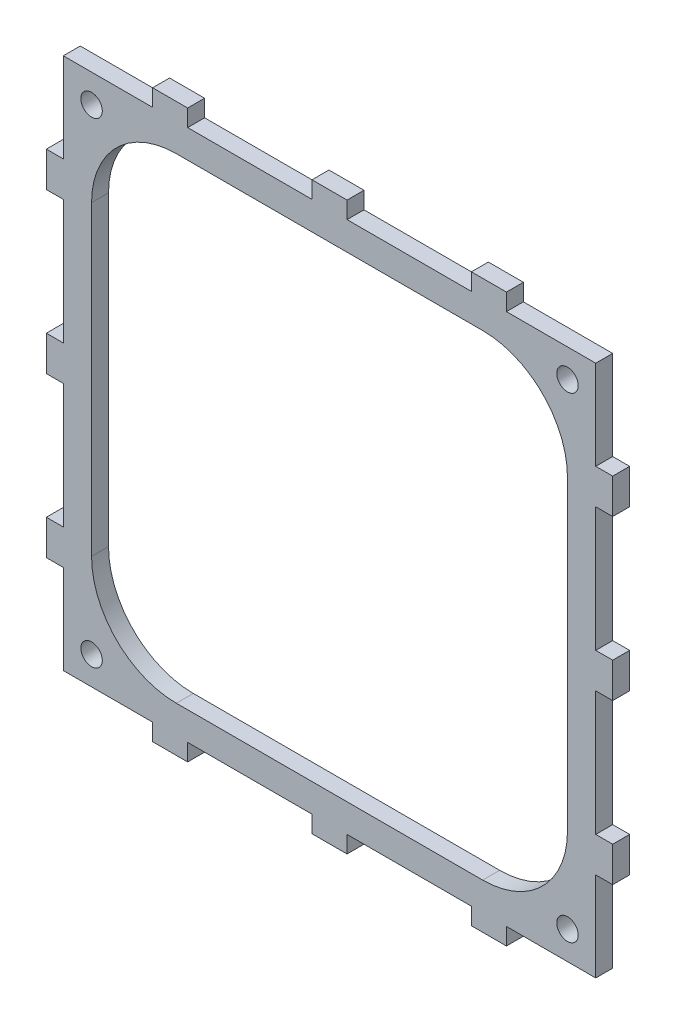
ISO-10303-21;
HEADER;
FILE_DESCRIPTION(('STEP AP214'),'2;1');
FILE_NAME('part.step','',(''),(''),'','','');
FILE_SCHEMA(('AUTOMOTIVE_DESIGN { 1 0 10303 214 1 1 1 1 }'));
ENDSEC;
DATA;
#1=APPLICATION_CONTEXT('core data for automotive mechanical design processes');
#2=APPLICATION_PROTOCOL_DEFINITION('international standard','automotive_design',2000,#1);
#3=PRODUCT_CONTEXT('',#1,'mechanical');
#4=PRODUCT('Part','Part','',(#3));
#5=PRODUCT_RELATED_PRODUCT_CATEGORY('part','',(#4));
#6=PRODUCT_DEFINITION_FORMATION('','',#4);
#7=PRODUCT_DEFINITION_CONTEXT('part definition',#1,'design');
#8=PRODUCT_DEFINITION('design','',#6,#7);
#9=PRODUCT_DEFINITION_SHAPE('','',#8);
#10=(LENGTH_UNIT() NAMED_UNIT(*) SI_UNIT(.MILLI.,.METRE.));
#11=(NAMED_UNIT(*) PLANE_ANGLE_UNIT() SI_UNIT($,.RADIAN.));
#12=(NAMED_UNIT(*) SI_UNIT($,.STERADIAN.) SOLID_ANGLE_UNIT());
#13=UNCERTAINTY_MEASURE_WITH_UNIT(LENGTH_MEASURE(1.E-05),#10,'distance_accuracy_value','');
#14=(GEOMETRIC_REPRESENTATION_CONTEXT(3) GLOBAL_UNCERTAINTY_ASSIGNED_CONTEXT((#13)) GLOBAL_UNIT_ASSIGNED_CONTEXT((#10,
#11,#12)) REPRESENTATION_CONTEXT('',''));
#15=CARTESIAN_POINT('',(0.,0.,0.));
#16=DIRECTION('',(0.,0.,1.));
#17=DIRECTION('',(1.,0.,0.));
#18=AXIS2_PLACEMENT_3D('',#15,#16,#17);
#19=CARTESIAN_POINT('',(0.,0.,3.));
#20=DIRECTION('',(0.,0.,-1.));
#21=DIRECTION('',(-1.,0.,0.));
#22=AXIS2_PLACEMENT_3D('',#19,#20,#21);
#23=PLANE('',#22);
#24=CARTESIAN_POINT('',(42.1,42.1,3.));
#25=DIRECTION('',(0.,0.,1.));
#26=DIRECTION('',(1.,0.,0.));
#27=AXIS2_PLACEMENT_3D('',#24,#25,#26);
#28=CIRCLE('',#27,1.89999999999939);
#29=CARTESIAN_POINT('',(43.9999999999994,42.1,3.));
#30=VERTEX_POINT('',#29);
#31=EDGE_CURVE('E459',#30,#30,#28,.T.);
#32=ORIENTED_EDGE('',*,*,#31,.F.);
#33=EDGE_LOOP('',(#32));
#34=FACE_BOUND('',#33,.T.);
#35=CARTESIAN_POINT('',(42.1,-42.0999999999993,3.));
#36=DIRECTION('',(0.,0.,1.));
#37=DIRECTION('',(1.,0.,0.));
#38=AXIS2_PLACEMENT_3D('',#35,#36,#37);
#39=CIRCLE('',#38,1.89999999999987);
#40=CARTESIAN_POINT('',(43.9999999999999,-42.0999999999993,3.));
#41=VERTEX_POINT('',#40);
#42=EDGE_CURVE('E465',#41,#41,#39,.T.);
#43=ORIENTED_EDGE('',*,*,#42,.F.);
#44=EDGE_LOOP('',(#43));
#45=FACE_BOUND('',#44,.T.);
#46=CARTESIAN_POINT('',(-42.0999999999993,-42.0999999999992,3.));
#47=DIRECTION('',(0.,0.,1.));
#48=DIRECTION('',(1.,0.,0.));
#49=AXIS2_PLACEMENT_3D('',#46,#47,#48);
#50=CIRCLE('',#49,1.89999999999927);
#51=CARTESIAN_POINT('',(-40.2,-42.0999999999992,3.));
#52=VERTEX_POINT('',#51);
#53=EDGE_CURVE('E471',#52,#52,#50,.T.);
#54=ORIENTED_EDGE('',*,*,#53,.F.);
#55=EDGE_LOOP('',(#54));
#56=FACE_BOUND('',#55,.T.);
#57=CARTESIAN_POINT('',(-42.0999999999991,42.1,3.));
#58=DIRECTION('',(0.,0.,1.));
#59=DIRECTION('',(1.,0.,0.));
#60=AXIS2_PLACEMENT_3D('',#57,#58,#59);
#61=CIRCLE('',#60,1.89999999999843);
#62=CARTESIAN_POINT('',(-40.2000000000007,42.1,3.));
#63=VERTEX_POINT('',#62);
#64=EDGE_CURVE('E477',#63,#63,#61,.T.);
#65=ORIENTED_EDGE('',*,*,#64,.F.);
#66=EDGE_LOOP('',(#65));
#67=FACE_BOUND('',#66,.T.);
#68=DIRECTION('',(0.,-1.,0.));
#69=VECTOR('',#68,1.);
#70=CARTESIAN_POINT('',(-47.1,25.1000000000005,3.));
#71=LINE('',#70,#69);
#72=CARTESIAN_POINT('',(-47.1,25.1000000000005,3.));
#73=VERTEX_POINT('',#72);
#74=CARTESIAN_POINT('',(-47.1,3.10000000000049,3.));
#75=VERTEX_POINT('',#74);
#76=EDGE_CURVE('E483',#73,#75,#71,.T.);
#77=ORIENTED_EDGE('',*,*,#76,.T.);
#78=DIRECTION('',(-1.,0.,0.));
#79=VECTOR('',#78,1.);
#80=CARTESIAN_POINT('',(-47.1,3.10000000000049,3.));
#81=LINE('',#80,#79);
#82=CARTESIAN_POINT('',(-50.1,3.10000000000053,3.));
#83=VERTEX_POINT('',#82);
#84=EDGE_CURVE('E486',#75,#83,#81,.T.);
#85=ORIENTED_EDGE('',*,*,#84,.T.);
#86=DIRECTION('',(0.,-1.,0.));
#87=VECTOR('',#86,1.);
#88=CARTESIAN_POINT('',(-50.1,3.10000000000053,3.));
#89=LINE('',#88,#87);
#90=CARTESIAN_POINT('',(-50.1,-3.09999999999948,3.));
#91=VERTEX_POINT('',#90);
#92=EDGE_CURVE('E489',#83,#91,#89,.T.);
#93=ORIENTED_EDGE('',*,*,#92,.T.);
#94=DIRECTION('',(1.,0.,0.));
#95=VECTOR('',#94,1.);
#96=CARTESIAN_POINT('',(-50.1,-3.09999999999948,3.));
#97=LINE('',#96,#95);
#98=CARTESIAN_POINT('',(-47.1,-3.09999999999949,3.));
#99=VERTEX_POINT('',#98);
#100=EDGE_CURVE('E491',#91,#99,#97,.T.);
#101=ORIENTED_EDGE('',*,*,#100,.T.);
#102=DIRECTION('',(0.,-1.,0.));
#103=VECTOR('',#102,1.);
#104=CARTESIAN_POINT('',(-47.1,-3.09999999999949,3.));
#105=LINE('',#104,#103);
#106=CARTESIAN_POINT('',(-47.1,-25.0999999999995,3.));
#107=VERTEX_POINT('',#106);
#108=EDGE_CURVE('E493',#99,#107,#105,.T.);
#109=ORIENTED_EDGE('',*,*,#108,.T.);
#110=DIRECTION('',(-1.,0.,0.));
#111=VECTOR('',#110,1.);
#112=CARTESIAN_POINT('',(-47.1,-25.0999999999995,3.));
#113=LINE('',#112,#111);
#114=CARTESIAN_POINT('',(-50.1,-25.0999999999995,3.));
#115=VERTEX_POINT('',#114);
#116=EDGE_CURVE('E495',#107,#115,#113,.T.);
#117=ORIENTED_EDGE('',*,*,#116,.T.);
#118=DIRECTION('',(0.,-1.,0.));
#119=VECTOR('',#118,1.);
#120=CARTESIAN_POINT('',(-50.1,-25.0999999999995,3.));
#121=LINE('',#120,#119);
#122=CARTESIAN_POINT('',(-50.1,-31.2999999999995,3.));
#123=VERTEX_POINT('',#122);
#124=EDGE_CURVE('E497',#115,#123,#121,.T.);
#125=ORIENTED_EDGE('',*,*,#124,.T.);
#126=DIRECTION('',(1.,0.,0.));
#127=VECTOR('',#126,1.);
#128=CARTESIAN_POINT('',(-50.1,-31.2999999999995,3.));
#129=LINE('',#128,#127);
#130=CARTESIAN_POINT('',(-47.1,-31.2999999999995,3.));
#131=VERTEX_POINT('',#130);
#132=EDGE_CURVE('E499',#123,#131,#129,.T.);
#133=ORIENTED_EDGE('',*,*,#132,.T.);
#134=DIRECTION('',(0.,-1.,0.));
#135=VECTOR('',#134,1.);
#136=CARTESIAN_POINT('',(-47.1,-31.2999999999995,3.));
#137=LINE('',#136,#135);
#138=CARTESIAN_POINT('',(-47.1,-47.1,3.));
#139=VERTEX_POINT('',#138);
#140=EDGE_CURVE('E501',#131,#139,#137,.T.);
#141=ORIENTED_EDGE('',*,*,#140,.T.);
#142=DIRECTION('',(1.,0.,0.));
#143=VECTOR('',#142,1.);
#144=CARTESIAN_POINT('',(-47.1,-47.1,3.));
#145=LINE('',#144,#143);
#146=CARTESIAN_POINT('',(-31.3000000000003,-47.1,3.));
#147=VERTEX_POINT('',#146);
#148=EDGE_CURVE('E503',#139,#147,#145,.T.);
#149=ORIENTED_EDGE('',*,*,#148,.T.);
#150=DIRECTION('',(0.,-1.,0.));
#151=VECTOR('',#150,1.);
#152=CARTESIAN_POINT('',(-31.3000000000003,-47.1,3.));
#153=LINE('',#152,#151);
#154=CARTESIAN_POINT('',(-31.3000000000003,-50.1,3.));
#155=VERTEX_POINT('',#154);
#156=EDGE_CURVE('E505',#147,#155,#153,.T.);
#157=ORIENTED_EDGE('',*,*,#156,.T.);
#158=DIRECTION('',(1.,0.,0.));
#159=VECTOR('',#158,1.);
#160=CARTESIAN_POINT('',(-31.3000000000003,-50.1,3.));
#161=LINE('',#160,#159);
#162=CARTESIAN_POINT('',(-25.1000000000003,-50.1,3.));
#163=VERTEX_POINT('',#162);
#164=EDGE_CURVE('E507',#155,#163,#161,.T.);
#165=ORIENTED_EDGE('',*,*,#164,.T.);
#166=DIRECTION('',(0.,1.,0.));
#167=VECTOR('',#166,1.);
#168=CARTESIAN_POINT('',(-25.1000000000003,-50.1,3.));
#169=LINE('',#168,#167);
#170=CARTESIAN_POINT('',(-25.1000000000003,-47.1,3.));
#171=VERTEX_POINT('',#170);
#172=EDGE_CURVE('E509',#163,#171,#169,.T.);
#173=ORIENTED_EDGE('',*,*,#172,.T.);
#174=DIRECTION('',(1.,0.,0.));
#175=VECTOR('',#174,1.);
#176=CARTESIAN_POINT('',(-25.1000000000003,-47.1,3.));
#177=LINE('',#176,#175);
#178=CARTESIAN_POINT('',(-3.10000000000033,-47.1,3.));
#179=VERTEX_POINT('',#178);
#180=EDGE_CURVE('E511',#171,#179,#177,.T.);
#181=ORIENTED_EDGE('',*,*,#180,.T.);
#182=DIRECTION('',(0.,-1.,0.));
#183=VECTOR('',#182,1.);
#184=CARTESIAN_POINT('',(-3.10000000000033,-47.1,3.));
#185=LINE('',#184,#183);
#186=CARTESIAN_POINT('',(-3.10000000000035,-50.1,3.));
#187=VERTEX_POINT('',#186);
#188=EDGE_CURVE('E513',#179,#187,#185,.T.);
#189=ORIENTED_EDGE('',*,*,#188,.T.);
#190=DIRECTION('',(1.,0.,0.));
#191=VECTOR('',#190,1.);
#192=CARTESIAN_POINT('',(-3.10000000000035,-50.1,3.));
#193=LINE('',#192,#191);
#194=CARTESIAN_POINT('',(3.09999999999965,-50.1,3.));
#195=VERTEX_POINT('',#194);
#196=EDGE_CURVE('E515',#187,#195,#193,.T.);
#197=ORIENTED_EDGE('',*,*,#196,.T.);
#198=DIRECTION('',(0.,1.,0.));
#199=VECTOR('',#198,1.);
#200=CARTESIAN_POINT('',(3.09999999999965,-50.1,3.));
#201=LINE('',#200,#199);
#202=CARTESIAN_POINT('',(3.09999999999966,-47.1,3.));
#203=VERTEX_POINT('',#202);
#204=EDGE_CURVE('E517',#195,#203,#201,.T.);
#205=ORIENTED_EDGE('',*,*,#204,.T.);
#206=DIRECTION('',(1.,0.,0.));
#207=VECTOR('',#206,1.);
#208=CARTESIAN_POINT('',(3.09999999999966,-47.1,3.));
#209=LINE('',#208,#207);
#210=CARTESIAN_POINT('',(25.0999999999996,-47.1,3.));
#211=VERTEX_POINT('',#210);
#212=EDGE_CURVE('E519',#203,#211,#209,.T.);
#213=ORIENTED_EDGE('',*,*,#212,.T.);
#214=DIRECTION('',(0.,-1.,0.));
#215=VECTOR('',#214,1.);
#216=CARTESIAN_POINT('',(25.0999999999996,-47.1,3.));
#217=LINE('',#216,#215);
#218=CARTESIAN_POINT('',(25.0999999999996,-50.1,3.));
#219=VERTEX_POINT('',#218);
#220=EDGE_CURVE('E521',#211,#219,#217,.T.);
#221=ORIENTED_EDGE('',*,*,#220,.T.);
#222=DIRECTION('',(1.,0.,0.));
#223=VECTOR('',#222,1.);
#224=CARTESIAN_POINT('',(25.0999999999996,-50.1,3.));
#225=LINE('',#224,#223);
#226=CARTESIAN_POINT('',(31.2999999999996,-50.1,3.));
#227=VERTEX_POINT('',#226);
#228=EDGE_CURVE('E523',#219,#227,#225,.T.);
#229=ORIENTED_EDGE('',*,*,#228,.T.);
#230=DIRECTION('',(0.,1.,0.));
#231=VECTOR('',#230,1.);
#232=CARTESIAN_POINT('',(31.2999999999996,-50.1,3.));
#233=LINE('',#232,#231);
#234=CARTESIAN_POINT('',(31.3,-47.1,3.));
#235=VERTEX_POINT('',#234);
#236=EDGE_CURVE('E525',#227,#235,#233,.T.);
#237=ORIENTED_EDGE('',*,*,#236,.T.);
#238=DIRECTION('',(1.,0.,0.));
#239=VECTOR('',#238,1.);
#240=CARTESIAN_POINT('',(31.3,-47.1,3.));
#241=LINE('',#240,#239);
#242=CARTESIAN_POINT('',(47.1,-47.1,3.));
#243=VERTEX_POINT('',#242);
#244=EDGE_CURVE('E527',#235,#243,#241,.T.);
#245=ORIENTED_EDGE('',*,*,#244,.T.);
#246=DIRECTION('',(0.,1.,0.));
#247=VECTOR('',#246,1.);
#248=CARTESIAN_POINT('',(47.1,-47.1,3.));
#249=LINE('',#248,#247);
#250=CARTESIAN_POINT('',(47.1,-31.3,3.));
#251=VERTEX_POINT('',#250);
#252=EDGE_CURVE('E529',#243,#251,#249,.T.);
#253=ORIENTED_EDGE('',*,*,#252,.T.);
#254=DIRECTION('',(1.,0.,0.));
#255=VECTOR('',#254,1.);
#256=CARTESIAN_POINT('',(47.1,-31.3,3.));
#257=LINE('',#256,#255);
#258=CARTESIAN_POINT('',(50.1,-31.3,3.));
#259=VERTEX_POINT('',#258);
#260=EDGE_CURVE('E531',#251,#259,#257,.T.);
#261=ORIENTED_EDGE('',*,*,#260,.T.);
#262=DIRECTION('',(0.,1.,0.));
#263=VECTOR('',#262,1.);
#264=CARTESIAN_POINT('',(50.1,-31.3,3.));
#265=LINE('',#264,#263);
#266=CARTESIAN_POINT('',(50.1,-25.1,3.));
#267=VERTEX_POINT('',#266);
#268=EDGE_CURVE('E533',#259,#267,#265,.T.);
#269=ORIENTED_EDGE('',*,*,#268,.T.);
#270=DIRECTION('',(-1.,0.,0.));
#271=VECTOR('',#270,1.);
#272=CARTESIAN_POINT('',(50.1,-25.1,3.));
#273=LINE('',#272,#271);
#274=CARTESIAN_POINT('',(47.1,-25.1,3.));
#275=VERTEX_POINT('',#274);
#276=EDGE_CURVE('E535',#267,#275,#273,.T.);
#277=ORIENTED_EDGE('',*,*,#276,.T.);
#278=DIRECTION('',(0.,1.,0.));
#279=VECTOR('',#278,1.);
#280=CARTESIAN_POINT('',(47.1,-25.1,3.));
#281=LINE('',#280,#279);
#282=CARTESIAN_POINT('',(47.1,-3.10000000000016,3.));
#283=VERTEX_POINT('',#282);
#284=EDGE_CURVE('E537',#275,#283,#281,.T.);
#285=ORIENTED_EDGE('',*,*,#284,.T.);
#286=DIRECTION('',(1.,0.,0.));
#287=VECTOR('',#286,1.);
#288=CARTESIAN_POINT('',(47.1,-3.10000000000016,3.));
#289=LINE('',#288,#287);
#290=CARTESIAN_POINT('',(50.1,-3.10000000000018,3.));
#291=VERTEX_POINT('',#290);
#292=EDGE_CURVE('E539',#283,#291,#289,.T.);
#293=ORIENTED_EDGE('',*,*,#292,.T.);
#294=DIRECTION('',(0.,1.,0.));
#295=VECTOR('',#294,1.);
#296=CARTESIAN_POINT('',(50.1,-3.10000000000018,3.));
#297=LINE('',#296,#295);
#298=CARTESIAN_POINT('',(50.1,3.09999999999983,3.));
#299=VERTEX_POINT('',#298);
#300=EDGE_CURVE('E541',#291,#299,#297,.T.);
#301=ORIENTED_EDGE('',*,*,#300,.T.);
#302=DIRECTION('',(-1.,0.,0.));
#303=VECTOR('',#302,1.);
#304=CARTESIAN_POINT('',(50.1,3.09999999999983,3.));
#305=LINE('',#304,#303);
#306=CARTESIAN_POINT('',(47.1,3.09999999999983,3.));
#307=VERTEX_POINT('',#306);
#308=EDGE_CURVE('E543',#299,#307,#305,.T.);
#309=ORIENTED_EDGE('',*,*,#308,.T.);
#310=DIRECTION('',(0.,1.,0.));
#311=VECTOR('',#310,1.);
#312=CARTESIAN_POINT('',(47.1,3.09999999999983,3.));
#313=LINE('',#312,#311);
#314=CARTESIAN_POINT('',(47.1,25.1,3.));
#315=VERTEX_POINT('',#314);
#316=EDGE_CURVE('E545',#307,#315,#313,.T.);
#317=ORIENTED_EDGE('',*,*,#316,.T.);
#318=DIRECTION('',(1.,0.,0.));
#319=VECTOR('',#318,1.);
#320=CARTESIAN_POINT('',(47.1,25.1,3.));
#321=LINE('',#320,#319);
#322=CARTESIAN_POINT('',(50.1,25.1,3.));
#323=VERTEX_POINT('',#322);
#324=EDGE_CURVE('E547',#315,#323,#321,.T.);
#325=ORIENTED_EDGE('',*,*,#324,.T.);
#326=DIRECTION('',(0.,1.,0.));
#327=VECTOR('',#326,1.);
#328=CARTESIAN_POINT('',(50.1,25.1,3.));
#329=LINE('',#328,#327);
#330=CARTESIAN_POINT('',(50.1,31.3,3.));
#331=VERTEX_POINT('',#330);
#332=EDGE_CURVE('E549',#323,#331,#329,.T.);
#333=ORIENTED_EDGE('',*,*,#332,.T.);
#334=DIRECTION('',(-1.,0.,0.));
#335=VECTOR('',#334,1.);
#336=CARTESIAN_POINT('',(50.1,31.3,3.));
#337=LINE('',#336,#335);
#338=CARTESIAN_POINT('',(47.1,31.3,3.));
#339=VERTEX_POINT('',#338);
#340=EDGE_CURVE('E551',#331,#339,#337,.T.);
#341=ORIENTED_EDGE('',*,*,#340,.T.);
#342=DIRECTION('',(0.,1.,0.));
#343=VECTOR('',#342,1.);
#344=CARTESIAN_POINT('',(47.1,31.3,3.));
#345=LINE('',#344,#343);
#346=CARTESIAN_POINT('',(47.1,47.1,3.));
#347=VERTEX_POINT('',#346);
#348=EDGE_CURVE('E553',#339,#347,#345,.T.);
#349=ORIENTED_EDGE('',*,*,#348,.T.);
#350=DIRECTION('',(-1.,0.,0.));
#351=VECTOR('',#350,1.);
#352=CARTESIAN_POINT('',(47.1,47.1,3.));
#353=LINE('',#352,#351);
#354=CARTESIAN_POINT('',(31.3,47.1,3.));
#355=VERTEX_POINT('',#354);
#356=EDGE_CURVE('E555',#347,#355,#353,.T.);
#357=ORIENTED_EDGE('',*,*,#356,.T.);
#358=DIRECTION('',(0.,1.,0.));
#359=VECTOR('',#358,1.);
#360=CARTESIAN_POINT('',(31.3,47.1,3.));
#361=LINE('',#360,#359);
#362=CARTESIAN_POINT('',(31.3,50.1,3.));
#363=VERTEX_POINT('',#362);
#364=EDGE_CURVE('E557',#355,#363,#361,.T.);
#365=ORIENTED_EDGE('',*,*,#364,.T.);
#366=DIRECTION('',(-1.,0.,0.));
#367=VECTOR('',#366,1.);
#368=CARTESIAN_POINT('',(31.3,50.1,3.));
#369=LINE('',#368,#367);
#370=CARTESIAN_POINT('',(25.1,50.1,3.));
#371=VERTEX_POINT('',#370);
#372=EDGE_CURVE('E559',#363,#371,#369,.T.);
#373=ORIENTED_EDGE('',*,*,#372,.T.);
#374=DIRECTION('',(0.,-1.,0.));
#375=VECTOR('',#374,1.);
#376=CARTESIAN_POINT('',(25.1,50.1,3.));
#377=LINE('',#376,#375);
#378=CARTESIAN_POINT('',(25.1,47.1,3.));
#379=VERTEX_POINT('',#378);
#380=EDGE_CURVE('E561',#371,#379,#377,.T.);
#381=ORIENTED_EDGE('',*,*,#380,.T.);
#382=DIRECTION('',(-1.,0.,0.));
#383=VECTOR('',#382,1.);
#384=CARTESIAN_POINT('',(25.1,47.1,3.));
#385=LINE('',#384,#383);
#386=CARTESIAN_POINT('',(3.1,47.1,3.));
#387=VERTEX_POINT('',#386);
#388=EDGE_CURVE('E563',#379,#387,#385,.T.);
#389=ORIENTED_EDGE('',*,*,#388,.T.);
#390=DIRECTION('',(0.,1.,0.));
#391=VECTOR('',#390,1.);
#392=CARTESIAN_POINT('',(3.1,47.1,3.));
#393=LINE('',#392,#391);
#394=CARTESIAN_POINT('',(3.1,50.1,3.));
#395=VERTEX_POINT('',#394);
#396=EDGE_CURVE('E565',#387,#395,#393,.T.);
#397=ORIENTED_EDGE('',*,*,#396,.T.);
#398=DIRECTION('',(-1.,0.,0.));
#399=VECTOR('',#398,1.);
#400=CARTESIAN_POINT('',(3.1,50.1,3.));
#401=LINE('',#400,#399);
#402=CARTESIAN_POINT('',(-3.1,50.1,3.));
#403=VERTEX_POINT('',#402);
#404=EDGE_CURVE('E567',#395,#403,#401,.T.);
#405=ORIENTED_EDGE('',*,*,#404,.T.);
#406=DIRECTION('',(0.,-1.,0.));
#407=VECTOR('',#406,1.);
#408=CARTESIAN_POINT('',(-3.1,50.1,3.));
#409=LINE('',#408,#407);
#410=CARTESIAN_POINT('',(-3.1,47.1,3.));
#411=VERTEX_POINT('',#410);
#412=EDGE_CURVE('E569',#403,#411,#409,.T.);
#413=ORIENTED_EDGE('',*,*,#412,.T.);
#414=DIRECTION('',(-1.,0.,0.));
#415=VECTOR('',#414,1.);
#416=CARTESIAN_POINT('',(-3.1,47.1,3.));
#417=LINE('',#416,#415);
#418=CARTESIAN_POINT('',(-25.1,47.1,3.));
#419=VERTEX_POINT('',#418);
#420=EDGE_CURVE('E571',#411,#419,#417,.T.);
#421=ORIENTED_EDGE('',*,*,#420,.T.);
#422=DIRECTION('',(0.,1.,0.));
#423=VECTOR('',#422,1.);
#424=CARTESIAN_POINT('',(-25.1,47.1,3.));
#425=LINE('',#424,#423);
#426=CARTESIAN_POINT('',(-25.1,50.1,3.));
#427=VERTEX_POINT('',#426);
#428=EDGE_CURVE('E573',#419,#427,#425,.T.);
#429=ORIENTED_EDGE('',*,*,#428,.T.);
#430=DIRECTION('',(-1.,0.,0.));
#431=VECTOR('',#430,1.);
#432=CARTESIAN_POINT('',(-25.1,50.1,3.));
#433=LINE('',#432,#431);
#434=CARTESIAN_POINT('',(-31.3,50.1,3.));
#435=VERTEX_POINT('',#434);
#436=EDGE_CURVE('E575',#427,#435,#433,.T.);
#437=ORIENTED_EDGE('',*,*,#436,.T.);
#438=DIRECTION('',(0.,-1.,0.));
#439=VECTOR('',#438,1.);
#440=CARTESIAN_POINT('',(-31.3,50.1,3.));
#441=LINE('',#440,#439);
#442=CARTESIAN_POINT('',(-31.3,47.1,3.));
#443=VERTEX_POINT('',#442);
#444=EDGE_CURVE('E577',#435,#443,#441,.T.);
#445=ORIENTED_EDGE('',*,*,#444,.T.);
#446=DIRECTION('',(-1.,0.,0.));
#447=VECTOR('',#446,1.);
#448=CARTESIAN_POINT('',(-31.3,47.1,3.));
#449=LINE('',#448,#447);
#450=CARTESIAN_POINT('',(-47.1,47.1,3.));
#451=VERTEX_POINT('',#450);
#452=EDGE_CURVE('E579',#443,#451,#449,.T.);
#453=ORIENTED_EDGE('',*,*,#452,.T.);
#454=DIRECTION('',(0.,-1.,0.));
#455=VECTOR('',#454,1.);
#456=CARTESIAN_POINT('',(-47.1,47.1,3.));
#457=LINE('',#456,#455);
#458=CARTESIAN_POINT('',(-47.1,31.3000000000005,3.));
#459=VERTEX_POINT('',#458);
#460=EDGE_CURVE('E581',#451,#459,#457,.T.);
#461=ORIENTED_EDGE('',*,*,#460,.T.);
#462=DIRECTION('',(-1.,0.,0.));
#463=VECTOR('',#462,1.);
#464=CARTESIAN_POINT('',(-47.1,31.3000000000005,3.));
#465=LINE('',#464,#463);
#466=CARTESIAN_POINT('',(-50.1,31.3000000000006,3.));
#467=VERTEX_POINT('',#466);
#468=EDGE_CURVE('E583',#459,#467,#465,.T.);
#469=ORIENTED_EDGE('',*,*,#468,.T.);
#470=DIRECTION('',(0.,-1.,0.));
#471=VECTOR('',#470,1.);
#472=CARTESIAN_POINT('',(-50.1,31.3000000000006,3.));
#473=LINE('',#472,#471);
#474=CARTESIAN_POINT('',(-50.1,25.1000000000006,3.));
#475=VERTEX_POINT('',#474);
#476=EDGE_CURVE('E585',#467,#475,#473,.T.);
#477=ORIENTED_EDGE('',*,*,#476,.T.);
#478=DIRECTION('',(1.,0.,0.));
#479=VECTOR('',#478,1.);
#480=CARTESIAN_POINT('',(-50.1,25.1000000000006,3.));
#481=LINE('',#480,#479);
#482=EDGE_CURVE('E587',#475,#73,#481,.T.);
#483=ORIENTED_EDGE('',*,*,#482,.T.);
#484=EDGE_LOOP('',(#77,#85,#93,#101,#109,#117,#125,#133,#141,#149,#157,#165,#173,#181,#189,#197,
#205,#213,#221,#229,#237,#245,#253,#261,#269,#277,#285,#293,#301,#309,#317,#325,#333,#341,#349,
#357,#365,#373,#381,#389,#397,#405,#413,#421,#429,#437,#445,#453,#461,#469,#477,#483));
#485=FACE_BOUND('',#484,.T.);
#486=CARTESIAN_POINT('',(-27.0999999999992,27.1,3.));
#487=DIRECTION('',(0.,0.,1.));
#488=DIRECTION('',(1.,0.,0.));
#489=AXIS2_PLACEMENT_3D('',#486,#487,#488);
#490=CIRCLE('',#489,15.);
#491=CARTESIAN_POINT('',(-27.0999999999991,42.1,3.));
#492=VERTEX_POINT('',#491);
#493=CARTESIAN_POINT('',(-42.0999999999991,27.1,3.));
#494=VERTEX_POINT('',#493);
#495=EDGE_CURVE('E394',#492,#494,#490,.T.);
#496=ORIENTED_EDGE('',*,*,#495,.F.);
#497=DIRECTION('',(-1.,0.,0.));
#498=VECTOR('',#497,1.);
#499=CARTESIAN_POINT('',(-27.0999999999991,42.1,3.));
#500=LINE('',#499,#498);
#501=CARTESIAN_POINT('',(27.1,42.1,3.));
#502=VERTEX_POINT('',#501);
#503=EDGE_CURVE('E427',#502,#492,#500,.T.);
#504=ORIENTED_EDGE('',*,*,#503,.F.);
#505=CARTESIAN_POINT('',(27.1,27.1,3.));
#506=DIRECTION('',(0.,0.,1.));
#507=DIRECTION('',(1.,0.,0.));
#508=AXIS2_PLACEMENT_3D('',#505,#506,#507);
#509=CIRCLE('',#508,15.);
#510=CARTESIAN_POINT('',(42.1,27.1,3.));
#511=VERTEX_POINT('',#510);
#512=EDGE_CURVE('E425',#511,#502,#509,.T.);
#513=ORIENTED_EDGE('',*,*,#512,.F.);
#514=DIRECTION('',(0.,1.,0.));
#515=VECTOR('',#514,1.);
#516=CARTESIAN_POINT('',(42.1,-27.0999999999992,3.));
#517=LINE('',#516,#515);
#518=CARTESIAN_POINT('',(42.1,-27.0999999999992,3.));
#519=VERTEX_POINT('',#518);
#520=EDGE_CURVE('E423',#519,#511,#517,.T.);
#521=ORIENTED_EDGE('',*,*,#520,.F.);
#522=CARTESIAN_POINT('',(27.1,-27.0999999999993,3.));
#523=DIRECTION('',(0.,0.,1.));
#524=DIRECTION('',(1.,0.,0.));
#525=AXIS2_PLACEMENT_3D('',#522,#523,#524);
#526=CIRCLE('',#525,15.);
#527=CARTESIAN_POINT('',(27.1,-42.0999999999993,3.));
#528=VERTEX_POINT('',#527);
#529=EDGE_CURVE('E421',#528,#519,#526,.T.);
#530=ORIENTED_EDGE('',*,*,#529,.F.);
#531=DIRECTION('',(1.,0.,0.));
#532=VECTOR('',#531,1.);
#533=CARTESIAN_POINT('',(-27.0999999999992,-42.0999999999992,3.));
#534=LINE('',#533,#532);
#535=CARTESIAN_POINT('',(-27.0999999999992,-42.0999999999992,3.));
#536=VERTEX_POINT('',#535);
#537=EDGE_CURVE('E417',#536,#528,#534,.T.);
#538=ORIENTED_EDGE('',*,*,#537,.F.);
#539=CARTESIAN_POINT('',(-27.0999999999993,-27.0999999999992,3.));
#540=DIRECTION('',(0.,0.,1.));
#541=DIRECTION('',(1.,0.,0.));
#542=AXIS2_PLACEMENT_3D('',#539,#540,#541);
#543=CIRCLE('',#542,15.);
#544=CARTESIAN_POINT('',(-42.0999999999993,-27.0999999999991,3.));
#545=VERTEX_POINT('',#544);
#546=EDGE_CURVE('E415',#545,#536,#543,.T.);
#547=ORIENTED_EDGE('',*,*,#546,.F.);
#548=DIRECTION('',(0.,-1.,0.));
#549=VECTOR('',#548,1.);
#550=CARTESIAN_POINT('',(-42.0999999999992,-27.0999999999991,3.));
#551=LINE('',#550,#549);
#552=EDGE_CURVE('E402',#494,#545,#551,.T.);
#553=ORIENTED_EDGE('',*,*,#552,.F.);
#554=EDGE_LOOP('',(#496,#504,#513,#521,#530,#538,#547,#553));
#555=FACE_BOUND('',#554,.T.);
#556=ADVANCED_FACE('F17',(#34,#45,#56,#67,#485,#555),#23,.F.);
#557=CARTESIAN_POINT('',(0.,0.,0.));
#558=DIRECTION('',(0.,0.,-1.));
#559=DIRECTION('',(-1.,0.,0.));
#560=AXIS2_PLACEMENT_3D('',#557,#558,#559);
#561=PLANE('',#560);
#562=CARTESIAN_POINT('',(42.1,-42.0999999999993,0.));
#563=DIRECTION('',(0.,0.,1.));
#564=DIRECTION('',(1.,0.,0.));
#565=AXIS2_PLACEMENT_3D('',#562,#563,#564);
#566=CIRCLE('',#565,1.89999999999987);
#567=CARTESIAN_POINT('',(43.9999999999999,-42.0999999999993,0.));
#568=VERTEX_POINT('',#567);
#569=EDGE_CURVE('E462',#568,#568,#566,.T.);
#570=ORIENTED_EDGE('',*,*,#569,.T.);
#571=EDGE_LOOP('',(#570));
#572=FACE_BOUND('',#571,.T.);
#573=CARTESIAN_POINT('',(-42.0999999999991,42.1,0.));
#574=DIRECTION('',(0.,0.,1.));
#575=DIRECTION('',(1.,0.,0.));
#576=AXIS2_PLACEMENT_3D('',#573,#574,#575);
#577=CIRCLE('',#576,1.89999999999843);
#578=CARTESIAN_POINT('',(-40.2000000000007,42.1,0.));
#579=VERTEX_POINT('',#578);
#580=EDGE_CURVE('E474',#579,#579,#577,.T.);
#581=ORIENTED_EDGE('',*,*,#580,.T.);
#582=EDGE_LOOP('',(#581));
#583=FACE_BOUND('',#582,.T.);
#584=DIRECTION('',(0.,-1.,0.));
#585=VECTOR('',#584,1.);
#586=CARTESIAN_POINT('',(-47.1,25.1000000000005,0.));
#587=LINE('',#586,#585);
#588=CARTESIAN_POINT('',(-47.1,25.1000000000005,0.));
#589=VERTEX_POINT('',#588);
#590=CARTESIAN_POINT('',(-47.1,3.10000000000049,0.));
#591=VERTEX_POINT('',#590);
#592=EDGE_CURVE('E480',#589,#591,#587,.T.);
#593=ORIENTED_EDGE('',*,*,#592,.F.);
#594=DIRECTION('',(1.,0.,0.));
#595=VECTOR('',#594,1.);
#596=CARTESIAN_POINT('',(-50.1,25.1000000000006,0.));
#597=LINE('',#596,#595);
#598=CARTESIAN_POINT('',(-50.1,25.1000000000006,0.));
#599=VERTEX_POINT('',#598);
#600=EDGE_CURVE('E487',#599,#589,#597,.T.);
#601=ORIENTED_EDGE('',*,*,#600,.F.);
#602=DIRECTION('',(0.,-1.,0.));
#603=VECTOR('',#602,1.);
#604=CARTESIAN_POINT('',(-50.1,31.3000000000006,0.));
#605=LINE('',#604,#603);
#606=CARTESIAN_POINT('',(-50.1,31.3000000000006,0.));
#607=VERTEX_POINT('',#606);
#608=EDGE_CURVE('E690',#607,#599,#605,.T.);
#609=ORIENTED_EDGE('',*,*,#608,.F.);
#610=DIRECTION('',(-1.,0.,0.));
#611=VECTOR('',#610,1.);
#612=CARTESIAN_POINT('',(-47.1,31.3000000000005,0.));
#613=LINE('',#612,#611);
#614=CARTESIAN_POINT('',(-47.1,31.3000000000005,0.));
#615=VERTEX_POINT('',#614);
#616=EDGE_CURVE('E688',#615,#607,#613,.T.);
#617=ORIENTED_EDGE('',*,*,#616,.F.);
#618=DIRECTION('',(0.,-1.,0.));
#619=VECTOR('',#618,1.);
#620=CARTESIAN_POINT('',(-47.1,47.1,0.));
#621=LINE('',#620,#619);
#622=CARTESIAN_POINT('',(-47.1,47.1,0.));
#623=VERTEX_POINT('',#622);
#624=EDGE_CURVE('E686',#623,#615,#621,.T.);
#625=ORIENTED_EDGE('',*,*,#624,.F.);
#626=DIRECTION('',(-1.,0.,0.));
#627=VECTOR('',#626,1.);
#628=CARTESIAN_POINT('',(-31.3,47.1,0.));
#629=LINE('',#628,#627);
#630=CARTESIAN_POINT('',(-31.3,47.1,0.));
#631=VERTEX_POINT('',#630);
#632=EDGE_CURVE('E684',#631,#623,#629,.T.);
#633=ORIENTED_EDGE('',*,*,#632,.F.);
#634=DIRECTION('',(0.,-1.,0.));
#635=VECTOR('',#634,1.);
#636=CARTESIAN_POINT('',(-31.3,50.1,0.));
#637=LINE('',#636,#635);
#638=CARTESIAN_POINT('',(-31.3,50.1,0.));
#639=VERTEX_POINT('',#638);
#640=EDGE_CURVE('E682',#639,#631,#637,.T.);
#641=ORIENTED_EDGE('',*,*,#640,.F.);
#642=DIRECTION('',(-1.,0.,0.));
#643=VECTOR('',#642,1.);
#644=CARTESIAN_POINT('',(-25.1,50.1,0.));
#645=LINE('',#644,#643);
#646=CARTESIAN_POINT('',(-25.1,50.1,0.));
#647=VERTEX_POINT('',#646);
#648=EDGE_CURVE('E680',#647,#639,#645,.T.);
#649=ORIENTED_EDGE('',*,*,#648,.F.);
#650=DIRECTION('',(0.,1.,0.));
#651=VECTOR('',#650,1.);
#652=CARTESIAN_POINT('',(-25.1,47.1,0.));
#653=LINE('',#652,#651);
#654=CARTESIAN_POINT('',(-25.1,47.1,0.));
#655=VERTEX_POINT('',#654);
#656=EDGE_CURVE('E678',#655,#647,#653,.T.);
#657=ORIENTED_EDGE('',*,*,#656,.F.);
#658=DIRECTION('',(-1.,0.,0.));
#659=VECTOR('',#658,1.);
#660=CARTESIAN_POINT('',(-3.1,47.1,0.));
#661=LINE('',#660,#659);
#662=CARTESIAN_POINT('',(-3.1,47.1,0.));
#663=VERTEX_POINT('',#662);
#664=EDGE_CURVE('E676',#663,#655,#661,.T.);
#665=ORIENTED_EDGE('',*,*,#664,.F.);
#666=DIRECTION('',(0.,-1.,0.));
#667=VECTOR('',#666,1.);
#668=CARTESIAN_POINT('',(-3.1,50.1,0.));
#669=LINE('',#668,#667);
#670=CARTESIAN_POINT('',(-3.1,50.1,0.));
#671=VERTEX_POINT('',#670);
#672=EDGE_CURVE('E674',#671,#663,#669,.T.);
#673=ORIENTED_EDGE('',*,*,#672,.F.);
#674=DIRECTION('',(-1.,0.,0.));
#675=VECTOR('',#674,1.);
#676=CARTESIAN_POINT('',(3.1,50.1,0.));
#677=LINE('',#676,#675);
#678=CARTESIAN_POINT('',(3.1,50.1,0.));
#679=VERTEX_POINT('',#678);
#680=EDGE_CURVE('E672',#679,#671,#677,.T.);
#681=ORIENTED_EDGE('',*,*,#680,.F.);
#682=DIRECTION('',(0.,1.,0.));
#683=VECTOR('',#682,1.);
#684=CARTESIAN_POINT('',(3.1,47.1,0.));
#685=LINE('',#684,#683);
#686=CARTESIAN_POINT('',(3.1,47.1,0.));
#687=VERTEX_POINT('',#686);
#688=EDGE_CURVE('E670',#687,#679,#685,.T.);
#689=ORIENTED_EDGE('',*,*,#688,.F.);
#690=DIRECTION('',(-1.,0.,0.));
#691=VECTOR('',#690,1.);
#692=CARTESIAN_POINT('',(25.1,47.1,0.));
#693=LINE('',#692,#691);
#694=CARTESIAN_POINT('',(25.1,47.1,0.));
#695=VERTEX_POINT('',#694);
#696=EDGE_CURVE('E668',#695,#687,#693,.T.);
#697=ORIENTED_EDGE('',*,*,#696,.F.);
#698=DIRECTION('',(0.,-1.,0.));
#699=VECTOR('',#698,1.);
#700=CARTESIAN_POINT('',(25.1,50.1,0.));
#701=LINE('',#700,#699);
#702=CARTESIAN_POINT('',(25.1,50.1,0.));
#703=VERTEX_POINT('',#702);
#704=EDGE_CURVE('E666',#703,#695,#701,.T.);
#705=ORIENTED_EDGE('',*,*,#704,.F.);
#706=DIRECTION('',(-1.,0.,0.));
#707=VECTOR('',#706,1.);
#708=CARTESIAN_POINT('',(31.3,50.1,0.));
#709=LINE('',#708,#707);
#710=CARTESIAN_POINT('',(31.3,50.1,0.));
#711=VERTEX_POINT('',#710);
#712=EDGE_CURVE('E664',#711,#703,#709,.T.);
#713=ORIENTED_EDGE('',*,*,#712,.F.);
#714=DIRECTION('',(0.,1.,0.));
#715=VECTOR('',#714,1.);
#716=CARTESIAN_POINT('',(31.3,47.1,0.));
#717=LINE('',#716,#715);
#718=CARTESIAN_POINT('',(31.3,47.1,0.));
#719=VERTEX_POINT('',#718);
#720=EDGE_CURVE('E662',#719,#711,#717,.T.);
#721=ORIENTED_EDGE('',*,*,#720,.F.);
#722=DIRECTION('',(-1.,0.,0.));
#723=VECTOR('',#722,1.);
#724=CARTESIAN_POINT('',(47.1,47.1,0.));
#725=LINE('',#724,#723);
#726=CARTESIAN_POINT('',(47.1,47.1,0.));
#727=VERTEX_POINT('',#726);
#728=EDGE_CURVE('E660',#727,#719,#725,.T.);
#729=ORIENTED_EDGE('',*,*,#728,.F.);
#730=DIRECTION('',(0.,1.,0.));
#731=VECTOR('',#730,1.);
#732=CARTESIAN_POINT('',(47.1,31.3,0.));
#733=LINE('',#732,#731);
#734=CARTESIAN_POINT('',(47.1,31.3,0.));
#735=VERTEX_POINT('',#734);
#736=EDGE_CURVE('E658',#735,#727,#733,.T.);
#737=ORIENTED_EDGE('',*,*,#736,.F.);
#738=DIRECTION('',(-1.,0.,0.));
#739=VECTOR('',#738,1.);
#740=CARTESIAN_POINT('',(50.1,31.3,0.));
#741=LINE('',#740,#739);
#742=CARTESIAN_POINT('',(50.1,31.3,0.));
#743=VERTEX_POINT('',#742);
#744=EDGE_CURVE('E656',#743,#735,#741,.T.);
#745=ORIENTED_EDGE('',*,*,#744,.F.);
#746=DIRECTION('',(0.,1.,0.));
#747=VECTOR('',#746,1.);
#748=CARTESIAN_POINT('',(50.1,25.1,0.));
#749=LINE('',#748,#747);
#750=CARTESIAN_POINT('',(50.1,25.1,0.));
#751=VERTEX_POINT('',#750);
#752=EDGE_CURVE('E654',#751,#743,#749,.T.);
#753=ORIENTED_EDGE('',*,*,#752,.F.);
#754=DIRECTION('',(1.,0.,0.));
#755=VECTOR('',#754,1.);
#756=CARTESIAN_POINT('',(47.1,25.1,0.));
#757=LINE('',#756,#755);
#758=CARTESIAN_POINT('',(47.1,25.1,0.));
#759=VERTEX_POINT('',#758);
#760=EDGE_CURVE('E652',#759,#751,#757,.T.);
#761=ORIENTED_EDGE('',*,*,#760,.F.);
#762=DIRECTION('',(0.,1.,0.));
#763=VECTOR('',#762,1.);
#764=CARTESIAN_POINT('',(47.1,3.09999999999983,0.));
#765=LINE('',#764,#763);
#766=CARTESIAN_POINT('',(47.1,3.09999999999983,0.));
#767=VERTEX_POINT('',#766);
#768=EDGE_CURVE('E650',#767,#759,#765,.T.);
#769=ORIENTED_EDGE('',*,*,#768,.F.);
#770=DIRECTION('',(-1.,0.,0.));
#771=VECTOR('',#770,1.);
#772=CARTESIAN_POINT('',(50.1,3.09999999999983,0.));
#773=LINE('',#772,#771);
#774=CARTESIAN_POINT('',(50.1,3.09999999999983,0.));
#775=VERTEX_POINT('',#774);
#776=EDGE_CURVE('E648',#775,#767,#773,.T.);
#777=ORIENTED_EDGE('',*,*,#776,.F.);
#778=DIRECTION('',(0.,1.,0.));
#779=VECTOR('',#778,1.);
#780=CARTESIAN_POINT('',(50.1,-3.10000000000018,0.));
#781=LINE('',#780,#779);
#782=CARTESIAN_POINT('',(50.1,-3.10000000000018,0.));
#783=VERTEX_POINT('',#782);
#784=EDGE_CURVE('E646',#783,#775,#781,.T.);
#785=ORIENTED_EDGE('',*,*,#784,.F.);
#786=DIRECTION('',(1.,0.,0.));
#787=VECTOR('',#786,1.);
#788=CARTESIAN_POINT('',(47.1,-3.10000000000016,0.));
#789=LINE('',#788,#787);
#790=CARTESIAN_POINT('',(47.1,-3.10000000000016,0.));
#791=VERTEX_POINT('',#790);
#792=EDGE_CURVE('E644',#791,#783,#789,.T.);
#793=ORIENTED_EDGE('',*,*,#792,.F.);
#794=DIRECTION('',(0.,1.,0.));
#795=VECTOR('',#794,1.);
#796=CARTESIAN_POINT('',(47.1,-25.1,0.));
#797=LINE('',#796,#795);
#798=CARTESIAN_POINT('',(47.1,-25.1,0.));
#799=VERTEX_POINT('',#798);
#800=EDGE_CURVE('E642',#799,#791,#797,.T.);
#801=ORIENTED_EDGE('',*,*,#800,.F.);
#802=DIRECTION('',(-1.,0.,0.));
#803=VECTOR('',#802,1.);
#804=CARTESIAN_POINT('',(50.1,-25.1,0.));
#805=LINE('',#804,#803);
#806=CARTESIAN_POINT('',(50.1,-25.1,0.));
#807=VERTEX_POINT('',#806);
#808=EDGE_CURVE('E640',#807,#799,#805,.T.);
#809=ORIENTED_EDGE('',*,*,#808,.F.);
#810=DIRECTION('',(0.,1.,0.));
#811=VECTOR('',#810,1.);
#812=CARTESIAN_POINT('',(50.1,-31.3,0.));
#813=LINE('',#812,#811);
#814=CARTESIAN_POINT('',(50.1,-31.3,0.));
#815=VERTEX_POINT('',#814);
#816=EDGE_CURVE('E638',#815,#807,#813,.T.);
#817=ORIENTED_EDGE('',*,*,#816,.F.);
#818=DIRECTION('',(1.,0.,0.));
#819=VECTOR('',#818,1.);
#820=CARTESIAN_POINT('',(47.1,-31.3,0.));
#821=LINE('',#820,#819);
#822=CARTESIAN_POINT('',(47.1,-31.3,0.));
#823=VERTEX_POINT('',#822);
#824=EDGE_CURVE('E636',#823,#815,#821,.T.);
#825=ORIENTED_EDGE('',*,*,#824,.F.);
#826=DIRECTION('',(0.,1.,0.));
#827=VECTOR('',#826,1.);
#828=CARTESIAN_POINT('',(47.1,-47.1,0.));
#829=LINE('',#828,#827);
#830=CARTESIAN_POINT('',(47.1,-47.1,0.));
#831=VERTEX_POINT('',#830);
#832=EDGE_CURVE('E634',#831,#823,#829,.T.);
#833=ORIENTED_EDGE('',*,*,#832,.F.);
#834=DIRECTION('',(1.,0.,0.));
#835=VECTOR('',#834,1.);
#836=CARTESIAN_POINT('',(31.3,-47.1,0.));
#837=LINE('',#836,#835);
#838=CARTESIAN_POINT('',(31.3,-47.1,0.));
#839=VERTEX_POINT('',#838);
#840=EDGE_CURVE('E632',#839,#831,#837,.T.);
#841=ORIENTED_EDGE('',*,*,#840,.F.);
#842=DIRECTION('',(0.,1.,0.));
#843=VECTOR('',#842,1.);
#844=CARTESIAN_POINT('',(31.2999999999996,-50.1,0.));
#845=LINE('',#844,#843);
#846=CARTESIAN_POINT('',(31.2999999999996,-50.1,0.));
#847=VERTEX_POINT('',#846);
#848=EDGE_CURVE('E630',#847,#839,#845,.T.);
#849=ORIENTED_EDGE('',*,*,#848,.F.);
#850=DIRECTION('',(1.,0.,0.));
#851=VECTOR('',#850,1.);
#852=CARTESIAN_POINT('',(25.0999999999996,-50.1,0.));
#853=LINE('',#852,#851);
#854=CARTESIAN_POINT('',(25.0999999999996,-50.1,0.));
#855=VERTEX_POINT('',#854);
#856=EDGE_CURVE('E628',#855,#847,#853,.T.);
#857=ORIENTED_EDGE('',*,*,#856,.F.);
#858=DIRECTION('',(0.,-1.,0.));
#859=VECTOR('',#858,1.);
#860=CARTESIAN_POINT('',(25.0999999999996,-47.1,0.));
#861=LINE('',#860,#859);
#862=CARTESIAN_POINT('',(25.0999999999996,-47.1,0.));
#863=VERTEX_POINT('',#862);
#864=EDGE_CURVE('E626',#863,#855,#861,.T.);
#865=ORIENTED_EDGE('',*,*,#864,.F.);
#866=DIRECTION('',(1.,0.,0.));
#867=VECTOR('',#866,1.);
#868=CARTESIAN_POINT('',(3.09999999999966,-47.1,0.));
#869=LINE('',#868,#867);
#870=CARTESIAN_POINT('',(3.09999999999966,-47.1,0.));
#871=VERTEX_POINT('',#870);
#872=EDGE_CURVE('E624',#871,#863,#869,.T.);
#873=ORIENTED_EDGE('',*,*,#872,.F.);
#874=DIRECTION('',(0.,1.,0.));
#875=VECTOR('',#874,1.);
#876=CARTESIAN_POINT('',(3.09999999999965,-50.1,0.));
#877=LINE('',#876,#875);
#878=CARTESIAN_POINT('',(3.09999999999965,-50.1,0.));
#879=VERTEX_POINT('',#878);
#880=EDGE_CURVE('E622',#879,#871,#877,.T.);
#881=ORIENTED_EDGE('',*,*,#880,.F.);
#882=DIRECTION('',(1.,0.,0.));
#883=VECTOR('',#882,1.);
#884=CARTESIAN_POINT('',(-3.10000000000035,-50.1,0.));
#885=LINE('',#884,#883);
#886=CARTESIAN_POINT('',(-3.10000000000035,-50.1,0.));
#887=VERTEX_POINT('',#886);
#888=EDGE_CURVE('E620',#887,#879,#885,.T.);
#889=ORIENTED_EDGE('',*,*,#888,.F.);
#890=DIRECTION('',(0.,-1.,0.));
#891=VECTOR('',#890,1.);
#892=CARTESIAN_POINT('',(-3.10000000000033,-47.1,0.));
#893=LINE('',#892,#891);
#894=CARTESIAN_POINT('',(-3.10000000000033,-47.1,0.));
#895=VERTEX_POINT('',#894);
#896=EDGE_CURVE('E618',#895,#887,#893,.T.);
#897=ORIENTED_EDGE('',*,*,#896,.F.);
#898=DIRECTION('',(1.,0.,0.));
#899=VECTOR('',#898,1.);
#900=CARTESIAN_POINT('',(-25.1000000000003,-47.1,0.));
#901=LINE('',#900,#899);
#902=CARTESIAN_POINT('',(-25.1000000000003,-47.1,0.));
#903=VERTEX_POINT('',#902);
#904=EDGE_CURVE('E616',#903,#895,#901,.T.);
#905=ORIENTED_EDGE('',*,*,#904,.F.);
#906=DIRECTION('',(0.,1.,0.));
#907=VECTOR('',#906,1.);
#908=CARTESIAN_POINT('',(-25.1000000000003,-50.1,0.));
#909=LINE('',#908,#907);
#910=CARTESIAN_POINT('',(-25.1000000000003,-50.1,0.));
#911=VERTEX_POINT('',#910);
#912=EDGE_CURVE('E614',#911,#903,#909,.T.);
#913=ORIENTED_EDGE('',*,*,#912,.F.);
#914=DIRECTION('',(1.,0.,0.));
#915=VECTOR('',#914,1.);
#916=CARTESIAN_POINT('',(-31.3000000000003,-50.1,0.));
#917=LINE('',#916,#915);
#918=CARTESIAN_POINT('',(-31.3000000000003,-50.1,0.));
#919=VERTEX_POINT('',#918);
#920=EDGE_CURVE('E612',#919,#911,#917,.T.);
#921=ORIENTED_EDGE('',*,*,#920,.F.);
#922=DIRECTION('',(0.,-1.,0.));
#923=VECTOR('',#922,1.);
#924=CARTESIAN_POINT('',(-31.3000000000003,-47.1,0.));
#925=LINE('',#924,#923);
#926=CARTESIAN_POINT('',(-31.3000000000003,-47.1,0.));
#927=VERTEX_POINT('',#926);
#928=EDGE_CURVE('E610',#927,#919,#925,.T.);
#929=ORIENTED_EDGE('',*,*,#928,.F.);
#930=DIRECTION('',(1.,0.,0.));
#931=VECTOR('',#930,1.);
#932=CARTESIAN_POINT('',(-47.1,-47.1,0.));
#933=LINE('',#932,#931);
#934=CARTESIAN_POINT('',(-47.1,-47.1,0.));
#935=VERTEX_POINT('',#934);
#936=EDGE_CURVE('E608',#935,#927,#933,.T.);
#937=ORIENTED_EDGE('',*,*,#936,.F.);
#938=DIRECTION('',(0.,-1.,0.));
#939=VECTOR('',#938,1.);
#940=CARTESIAN_POINT('',(-47.1,-31.2999999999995,0.));
#941=LINE('',#940,#939);
#942=CARTESIAN_POINT('',(-47.1,-31.2999999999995,0.));
#943=VERTEX_POINT('',#942);
#944=EDGE_CURVE('E606',#943,#935,#941,.T.);
#945=ORIENTED_EDGE('',*,*,#944,.F.);
#946=DIRECTION('',(1.,0.,0.));
#947=VECTOR('',#946,1.);
#948=CARTESIAN_POINT('',(-50.1,-31.2999999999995,0.));
#949=LINE('',#948,#947);
#950=CARTESIAN_POINT('',(-50.1,-31.2999999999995,0.));
#951=VERTEX_POINT('',#950);
#952=EDGE_CURVE('E604',#951,#943,#949,.T.);
#953=ORIENTED_EDGE('',*,*,#952,.F.);
#954=DIRECTION('',(0.,-1.,0.));
#955=VECTOR('',#954,1.);
#956=CARTESIAN_POINT('',(-50.1,-25.0999999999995,0.));
#957=LINE('',#956,#955);
#958=CARTESIAN_POINT('',(-50.1,-25.0999999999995,0.));
#959=VERTEX_POINT('',#958);
#960=EDGE_CURVE('E602',#959,#951,#957,.T.);
#961=ORIENTED_EDGE('',*,*,#960,.F.);
#962=DIRECTION('',(-1.,0.,0.));
#963=VECTOR('',#962,1.);
#964=CARTESIAN_POINT('',(-47.1,-25.0999999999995,0.));
#965=LINE('',#964,#963);
#966=CARTESIAN_POINT('',(-47.1,-25.0999999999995,0.));
#967=VERTEX_POINT('',#966);
#968=EDGE_CURVE('E600',#967,#959,#965,.T.);
#969=ORIENTED_EDGE('',*,*,#968,.F.);
#970=DIRECTION('',(0.,-1.,0.));
#971=VECTOR('',#970,1.);
#972=CARTESIAN_POINT('',(-47.1,-3.09999999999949,0.));
#973=LINE('',#972,#971);
#974=CARTESIAN_POINT('',(-47.1,-3.09999999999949,0.));
#975=VERTEX_POINT('',#974);
#976=EDGE_CURVE('E598',#975,#967,#973,.T.);
#977=ORIENTED_EDGE('',*,*,#976,.F.);
#978=DIRECTION('',(1.,0.,0.));
#979=VECTOR('',#978,1.);
#980=CARTESIAN_POINT('',(-50.1,-3.09999999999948,0.));
#981=LINE('',#980,#979);
#982=CARTESIAN_POINT('',(-50.1,-3.09999999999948,0.));
#983=VERTEX_POINT('',#982);
#984=EDGE_CURVE('E596',#983,#975,#981,.T.);
#985=ORIENTED_EDGE('',*,*,#984,.F.);
#986=DIRECTION('',(0.,-1.,0.));
#987=VECTOR('',#986,1.);
#988=CARTESIAN_POINT('',(-50.1,3.10000000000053,0.));
#989=LINE('',#988,#987);
#990=CARTESIAN_POINT('',(-50.1,3.10000000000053,0.));
#991=VERTEX_POINT('',#990);
#992=EDGE_CURVE('E594',#991,#983,#989,.T.);
#993=ORIENTED_EDGE('',*,*,#992,.F.);
#994=DIRECTION('',(-1.,0.,0.));
#995=VECTOR('',#994,1.);
#996=CARTESIAN_POINT('',(-47.1,3.10000000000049,0.));
#997=LINE('',#996,#995);
#998=EDGE_CURVE('E592',#591,#991,#997,.T.);
#999=ORIENTED_EDGE('',*,*,#998,.F.);
#1000=EDGE_LOOP('',(#593,#601,#609,#617,#625,#633,#641,#649,#657,#665,#673,#681,#689,#697,#705,
#713,#721,#729,#737,#745,#753,#761,#769,#777,#785,#793,#801,#809,#817,#825,#833,#841,#849,#857,
#865,#873,#881,#889,#897,#905,#913,#921,#929,#937,#945,#953,#961,#969,#977,#985,#993,#999));
#1001=FACE_BOUND('',#1000,.T.);
#1002=CARTESIAN_POINT('',(-42.0999999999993,-42.0999999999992,0.));
#1003=DIRECTION('',(0.,0.,1.));
#1004=DIRECTION('',(1.,0.,0.));
#1005=AXIS2_PLACEMENT_3D('',#1002,#1003,#1004);
#1006=CIRCLE('',#1005,1.89999999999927);
#1007=CARTESIAN_POINT('',(-40.2,-42.0999999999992,0.));
#1008=VERTEX_POINT('',#1007);
#1009=EDGE_CURVE('E468',#1008,#1008,#1006,.T.);
#1010=ORIENTED_EDGE('',*,*,#1009,.T.);
#1011=EDGE_LOOP('',(#1010));
#1012=FACE_BOUND('',#1011,.T.);
#1013=CARTESIAN_POINT('',(42.1,42.1,0.));
#1014=DIRECTION('',(0.,0.,1.));
#1015=DIRECTION('',(1.,0.,0.));
#1016=AXIS2_PLACEMENT_3D('',#1013,#1014,#1015);
#1017=CIRCLE('',#1016,1.89999999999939);
#1018=CARTESIAN_POINT('',(43.9999999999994,42.1,0.));
#1019=VERTEX_POINT('',#1018);
#1020=EDGE_CURVE('E410',#1019,#1019,#1017,.T.);
#1021=ORIENTED_EDGE('',*,*,#1020,.T.);
#1022=EDGE_LOOP('',(#1021));
#1023=FACE_BOUND('',#1022,.T.);
#1024=DIRECTION('',(-1.,0.,0.));
#1025=VECTOR('',#1024,1.);
#1026=CARTESIAN_POINT('',(-27.0999999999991,42.1,0.));
#1027=LINE('',#1026,#1025);
#1028=CARTESIAN_POINT('',(27.1,42.1,0.));
#1029=VERTEX_POINT('',#1028);
#1030=CARTESIAN_POINT('',(-27.0999999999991,42.1,0.));
#1031=VERTEX_POINT('',#1030);
#1032=EDGE_CURVE('E403',#1029,#1031,#1027,.T.);
#1033=ORIENTED_EDGE('',*,*,#1032,.T.);
#1034=CARTESIAN_POINT('',(-27.0999999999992,27.1,0.));
#1035=DIRECTION('',(0.,0.,1.));
#1036=DIRECTION('',(1.,0.,0.));
#1037=AXIS2_PLACEMENT_3D('',#1034,#1035,#1036);
#1038=CIRCLE('',#1037,15.);
#1039=CARTESIAN_POINT('',(-42.0999999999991,27.1,0.));
#1040=VERTEX_POINT('',#1039);
#1041=EDGE_CURVE('E40',#1031,#1040,#1038,.T.);
#1042=ORIENTED_EDGE('',*,*,#1041,.T.);
#1043=DIRECTION('',(0.,-1.,0.));
#1044=VECTOR('',#1043,1.);
#1045=CARTESIAN_POINT('',(-42.0999999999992,-27.0999999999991,0.));
#1046=LINE('',#1045,#1044);
#1047=CARTESIAN_POINT('',(-42.0999999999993,-27.0999999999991,0.));
#1048=VERTEX_POINT('',#1047);
#1049=EDGE_CURVE('E409',#1040,#1048,#1046,.T.);
#1050=ORIENTED_EDGE('',*,*,#1049,.T.);
#1051=CARTESIAN_POINT('',(-27.0999999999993,-27.0999999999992,0.));
#1052=DIRECTION('',(0.,0.,1.));
#1053=DIRECTION('',(1.,0.,0.));
#1054=AXIS2_PLACEMENT_3D('',#1051,#1052,#1053);
#1055=CIRCLE('',#1054,15.);
#1056=CARTESIAN_POINT('',(-27.0999999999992,-42.0999999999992,0.));
#1057=VERTEX_POINT('',#1056);
#1058=EDGE_CURVE('E431',#1048,#1057,#1055,.T.);
#1059=ORIENTED_EDGE('',*,*,#1058,.T.);
#1060=DIRECTION('',(1.,0.,0.));
#1061=VECTOR('',#1060,1.);
#1062=CARTESIAN_POINT('',(-27.0999999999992,-42.0999999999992,0.));
#1063=LINE('',#1062,#1061);
#1064=CARTESIAN_POINT('',(27.1,-42.0999999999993,0.));
#1065=VERTEX_POINT('',#1064);
#1066=EDGE_CURVE('E434',#1057,#1065,#1063,.T.);
#1067=ORIENTED_EDGE('',*,*,#1066,.T.);
#1068=CARTESIAN_POINT('',(27.1,-27.0999999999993,0.));
#1069=DIRECTION('',(0.,0.,1.));
#1070=DIRECTION('',(1.,0.,0.));
#1071=AXIS2_PLACEMENT_3D('',#1068,#1069,#1070);
#1072=CIRCLE('',#1071,15.);
#1073=CARTESIAN_POINT('',(42.1,-27.0999999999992,0.));
#1074=VERTEX_POINT('',#1073);
#1075=EDGE_CURVE('E437',#1065,#1074,#1072,.T.);
#1076=ORIENTED_EDGE('',*,*,#1075,.T.);
#1077=DIRECTION('',(0.,1.,0.));
#1078=VECTOR('',#1077,1.);
#1079=CARTESIAN_POINT('',(42.1,-27.0999999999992,0.));
#1080=LINE('',#1079,#1078);
#1081=CARTESIAN_POINT('',(42.1,27.1,0.));
#1082=VERTEX_POINT('',#1081);
#1083=EDGE_CURVE('E440',#1074,#1082,#1080,.T.);
#1084=ORIENTED_EDGE('',*,*,#1083,.T.);
#1085=CARTESIAN_POINT('',(27.1,27.1,0.));
#1086=DIRECTION('',(0.,0.,1.));
#1087=DIRECTION('',(1.,0.,0.));
#1088=AXIS2_PLACEMENT_3D('',#1085,#1086,#1087);
#1089=CIRCLE('',#1088,15.);
#1090=EDGE_CURVE('E443',#1082,#1029,#1089,.T.);
#1091=ORIENTED_EDGE('',*,*,#1090,.T.);
#1092=EDGE_LOOP('',(#1033,#1042,#1050,#1059,#1067,#1076,#1084,#1091));
#1093=FACE_BOUND('',#1092,.T.);
#1094=ADVANCED_FACE('F852',(#572,#583,#1001,#1012,#1023,#1093),#561,.T.);
#1095=CARTESIAN_POINT('',(-47.1,25.1000000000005,3.));
#1096=DIRECTION('',(1.,0.,0.));
#1097=DIRECTION('',(0.,0.,-1.));
#1098=AXIS2_PLACEMENT_3D('',#1095,#1096,#1097);
#1099=PLANE('',#1098);
#1100=ORIENTED_EDGE('',*,*,#592,.T.);
#1101=DIRECTION('',(0.,0.,-1.));
#1102=VECTOR('',#1101,1.);
#1103=CARTESIAN_POINT('',(-47.1,3.10000000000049,3.));
#1104=LINE('',#1103,#1102);
#1105=EDGE_CURVE('E11',#75,#591,#1104,.T.);
#1106=ORIENTED_EDGE('',*,*,#1105,.F.);
#1107=ORIENTED_EDGE('',*,*,#76,.F.);
#1108=DIRECTION('',(0.,0.,-1.));
#1109=VECTOR('',#1108,1.);
#1110=CARTESIAN_POINT('',(-47.1,25.1000000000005,3.));
#1111=LINE('',#1110,#1109);
#1112=EDGE_CURVE('E589',#73,#589,#1111,.T.);
#1113=ORIENTED_EDGE('',*,*,#1112,.T.);
#1114=EDGE_LOOP('',(#1100,#1106,#1107,#1113));
#1115=FACE_BOUND('',#1114,.T.);
#1116=ADVANCED_FACE('F19',(#1115),#1099,.F.);
#1117=CARTESIAN_POINT('',(-47.1,3.10000000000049,3.));
#1118=DIRECTION('',(0.,-1.,0.));
#1119=DIRECTION('',(1.,0.,0.));
#1120=AXIS2_PLACEMENT_3D('',#1117,#1118,#1119);
#1121=PLANE('',#1120);
#1122=ORIENTED_EDGE('',*,*,#998,.T.);
#1123=DIRECTION('',(0.,0.,-1.));
#1124=VECTOR('',#1123,1.);
#1125=CARTESIAN_POINT('',(-50.1,3.10000000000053,3.));
#1126=LINE('',#1125,#1124);
#1127=EDGE_CURVE('E25',#83,#991,#1126,.T.);
#1128=ORIENTED_EDGE('',*,*,#1127,.F.);
#1129=ORIENTED_EDGE('',*,*,#84,.F.);
#1130=ORIENTED_EDGE('',*,*,#1105,.T.);
#1131=EDGE_LOOP('',(#1122,#1128,#1129,#1130));
#1132=FACE_BOUND('',#1131,.T.);
#1133=ADVANCED_FACE('F869',(#1132),#1121,.F.);
#1134=CARTESIAN_POINT('',(-50.1,3.10000000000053,3.));
#1135=DIRECTION('',(1.,0.,0.));
#1136=DIRECTION('',(0.,1.,0.));
#1137=AXIS2_PLACEMENT_3D('',#1134,#1135,#1136);
#1138=PLANE('',#1137);
#1139=ORIENTED_EDGE('',*,*,#992,.T.);
#1140=DIRECTION('',(0.,0.,-1.));
#1141=VECTOR('',#1140,1.);
#1142=CARTESIAN_POINT('',(-50.1,-3.09999999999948,3.));
#1143=LINE('',#1142,#1141);
#1144=EDGE_CURVE('E839',#91,#983,#1143,.T.);
#1145=ORIENTED_EDGE('',*,*,#1144,.F.);
#1146=ORIENTED_EDGE('',*,*,#92,.F.);
#1147=ORIENTED_EDGE('',*,*,#1127,.T.);
#1148=EDGE_LOOP('',(#1139,#1145,#1146,#1147));
#1149=FACE_BOUND('',#1148,.T.);
#1150=ADVANCED_FACE('F846',(#1149),#1138,.F.);
#1151=CARTESIAN_POINT('',(-50.1,-3.09999999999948,3.));
#1152=DIRECTION('',(0.,1.,0.));
#1153=DIRECTION('',(-1.,0.,0.));
#1154=AXIS2_PLACEMENT_3D('',#1151,#1152,#1153);
#1155=PLANE('',#1154);
#1156=ORIENTED_EDGE('',*,*,#984,.T.);
#1157=DIRECTION('',(0.,0.,-1.));
#1158=VECTOR('',#1157,1.);
#1159=CARTESIAN_POINT('',(-47.1,-3.09999999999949,3.));
#1160=LINE('',#1159,#1158);
#1161=EDGE_CURVE('E836',#99,#975,#1160,.T.);
#1162=ORIENTED_EDGE('',*,*,#1161,.F.);
#1163=ORIENTED_EDGE('',*,*,#100,.F.);
#1164=ORIENTED_EDGE('',*,*,#1144,.T.);
#1165=EDGE_LOOP('',(#1156,#1162,#1163,#1164));
#1166=FACE_BOUND('',#1165,.T.);
#1167=ADVANCED_FACE('F858',(#1166),#1155,.F.);
#1168=CARTESIAN_POINT('',(-47.1,-3.09999999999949,3.));
#1169=DIRECTION('',(1.,0.,0.));
#1170=DIRECTION('',(0.,0.,-1.));
#1171=AXIS2_PLACEMENT_3D('',#1168,#1169,#1170);
#1172=PLANE('',#1171);
#1173=ORIENTED_EDGE('',*,*,#976,.T.);
#1174=DIRECTION('',(0.,0.,-1.));
#1175=VECTOR('',#1174,1.);
#1176=CARTESIAN_POINT('',(-47.1,-25.0999999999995,3.));
#1177=LINE('',#1176,#1175);
#1178=EDGE_CURVE('E833',#107,#967,#1177,.T.);
#1179=ORIENTED_EDGE('',*,*,#1178,.F.);
#1180=ORIENTED_EDGE('',*,*,#108,.F.);
#1181=ORIENTED_EDGE('',*,*,#1161,.T.);
#1182=EDGE_LOOP('',(#1173,#1179,#1180,#1181));
#1183=FACE_BOUND('',#1182,.T.);
#1184=ADVANCED_FACE('F862',(#1183),#1172,.F.);
#1185=CARTESIAN_POINT('',(-47.1,-25.0999999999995,3.));
#1186=DIRECTION('',(0.,-1.,0.));
#1187=DIRECTION('',(1.,0.,0.));
#1188=AXIS2_PLACEMENT_3D('',#1185,#1186,#1187);
#1189=PLANE('',#1188);
#1190=ORIENTED_EDGE('',*,*,#968,.T.);
#1191=DIRECTION('',(0.,0.,-1.));
#1192=VECTOR('',#1191,1.);
#1193=CARTESIAN_POINT('',(-50.1,-25.0999999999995,3.));
#1194=LINE('',#1193,#1192);
#1195=EDGE_CURVE('E830',#115,#959,#1194,.T.);
#1196=ORIENTED_EDGE('',*,*,#1195,.F.);
#1197=ORIENTED_EDGE('',*,*,#116,.F.);
#1198=ORIENTED_EDGE('',*,*,#1178,.T.);
#1199=EDGE_LOOP('',(#1190,#1196,#1197,#1198));
#1200=FACE_BOUND('',#1199,.T.);
#1201=ADVANCED_FACE('F1102',(#1200),#1189,.F.);
#1202=CARTESIAN_POINT('',(-50.1,-25.0999999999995,3.));
#1203=DIRECTION('',(1.,0.,0.));
#1204=DIRECTION('',(0.,1.,0.));
#1205=AXIS2_PLACEMENT_3D('',#1202,#1203,#1204);
#1206=PLANE('',#1205);
#1207=ORIENTED_EDGE('',*,*,#960,.T.);
#1208=DIRECTION('',(0.,0.,-1.));
#1209=VECTOR('',#1208,1.);
#1210=CARTESIAN_POINT('',(-50.1,-31.2999999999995,3.));
#1211=LINE('',#1210,#1209);
#1212=EDGE_CURVE('E827',#123,#951,#1211,.T.);
#1213=ORIENTED_EDGE('',*,*,#1212,.F.);
#1214=ORIENTED_EDGE('',*,*,#124,.F.);
#1215=ORIENTED_EDGE('',*,*,#1195,.T.);
#1216=EDGE_LOOP('',(#1207,#1213,#1214,#1215));
#1217=FACE_BOUND('',#1216,.T.);
#1218=ADVANCED_FACE('F1099',(#1217),#1206,.F.);
#1219=CARTESIAN_POINT('',(-50.1,-31.2999999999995,3.));
#1220=DIRECTION('',(0.,1.,0.));
#1221=DIRECTION('',(-1.,0.,0.));
#1222=AXIS2_PLACEMENT_3D('',#1219,#1220,#1221);
#1223=PLANE('',#1222);
#1224=ORIENTED_EDGE('',*,*,#952,.T.);
#1225=DIRECTION('',(0.,0.,-1.));
#1226=VECTOR('',#1225,1.);
#1227=CARTESIAN_POINT('',(-47.1,-31.2999999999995,3.));
#1228=LINE('',#1227,#1226);
#1229=EDGE_CURVE('E824',#131,#943,#1228,.T.);
#1230=ORIENTED_EDGE('',*,*,#1229,.F.);
#1231=ORIENTED_EDGE('',*,*,#132,.F.);
#1232=ORIENTED_EDGE('',*,*,#1212,.T.);
#1233=EDGE_LOOP('',(#1224,#1230,#1231,#1232));
#1234=FACE_BOUND('',#1233,.T.);
#1235=ADVANCED_FACE('F1095',(#1234),#1223,.F.);
#1236=CARTESIAN_POINT('',(-47.1,-31.2999999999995,3.));
#1237=DIRECTION('',(1.,0.,0.));
#1238=DIRECTION('',(0.,0.,-1.));
#1239=AXIS2_PLACEMENT_3D('',#1236,#1237,#1238);
#1240=PLANE('',#1239);
#1241=ORIENTED_EDGE('',*,*,#944,.T.);
#1242=DIRECTION('',(0.,0.,-1.));
#1243=VECTOR('',#1242,1.);
#1244=CARTESIAN_POINT('',(-47.1,-47.1,3.));
#1245=LINE('',#1244,#1243);
#1246=EDGE_CURVE('E821',#139,#935,#1245,.T.);
#1247=ORIENTED_EDGE('',*,*,#1246,.F.);
#1248=ORIENTED_EDGE('',*,*,#140,.F.);
#1249=ORIENTED_EDGE('',*,*,#1229,.T.);
#1250=EDGE_LOOP('',(#1241,#1247,#1248,#1249));
#1251=FACE_BOUND('',#1250,.T.);
#1252=ADVANCED_FACE('F1091',(#1251),#1240,.F.);
#1253=CARTESIAN_POINT('',(-47.1,-47.1,3.));
#1254=DIRECTION('',(0.,1.,0.));
#1255=DIRECTION('',(0.,0.,1.));
#1256=AXIS2_PLACEMENT_3D('',#1253,#1254,#1255);
#1257=PLANE('',#1256);
#1258=ORIENTED_EDGE('',*,*,#936,.T.);
#1259=DIRECTION('',(0.,0.,-1.));
#1260=VECTOR('',#1259,1.);
#1261=CARTESIAN_POINT('',(-31.3000000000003,-47.1,3.));
#1262=LINE('',#1261,#1260);
#1263=EDGE_CURVE('E818',#147,#927,#1262,.T.);
#1264=ORIENTED_EDGE('',*,*,#1263,.F.);
#1265=ORIENTED_EDGE('',*,*,#148,.F.);
#1266=ORIENTED_EDGE('',*,*,#1246,.T.);
#1267=EDGE_LOOP('',(#1258,#1264,#1265,#1266));
#1268=FACE_BOUND('',#1267,.T.);
#1269=ADVANCED_FACE('F1086',(#1268),#1257,.F.);
#1270=CARTESIAN_POINT('',(-31.3000000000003,-47.1,3.));
#1271=DIRECTION('',(1.,0.,0.));
#1272=DIRECTION('',(0.,1.,0.));
#1273=AXIS2_PLACEMENT_3D('',#1270,#1271,#1272);
#1274=PLANE('',#1273);
#1275=ORIENTED_EDGE('',*,*,#928,.T.);
#1276=DIRECTION('',(0.,0.,-1.));
#1277=VECTOR('',#1276,1.);
#1278=CARTESIAN_POINT('',(-31.3000000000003,-50.1,3.));
#1279=LINE('',#1278,#1277);
#1280=EDGE_CURVE('E815',#155,#919,#1279,.T.);
#1281=ORIENTED_EDGE('',*,*,#1280,.F.);
#1282=ORIENTED_EDGE('',*,*,#156,.F.);
#1283=ORIENTED_EDGE('',*,*,#1263,.T.);
#1284=EDGE_LOOP('',(#1275,#1281,#1282,#1283));
#1285=FACE_BOUND('',#1284,.T.);
#1286=ADVANCED_FACE('F1080',(#1285),#1274,.F.);
#1287=CARTESIAN_POINT('',(-31.3000000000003,-50.1,3.));
#1288=DIRECTION('',(0.,1.,0.));
#1289=DIRECTION('',(-1.,0.,0.));
#1290=AXIS2_PLACEMENT_3D('',#1287,#1288,#1289);
#1291=PLANE('',#1290);
#1292=ORIENTED_EDGE('',*,*,#920,.T.);
#1293=DIRECTION('',(0.,0.,-1.));
#1294=VECTOR('',#1293,1.);
#1295=CARTESIAN_POINT('',(-25.1000000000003,-50.1,3.));
#1296=LINE('',#1295,#1294);
#1297=EDGE_CURVE('E812',#163,#911,#1296,.T.);
#1298=ORIENTED_EDGE('',*,*,#1297,.F.);
#1299=ORIENTED_EDGE('',*,*,#164,.F.);
#1300=ORIENTED_EDGE('',*,*,#1280,.T.);
#1301=EDGE_LOOP('',(#1292,#1298,#1299,#1300));
#1302=FACE_BOUND('',#1301,.T.);
#1303=ADVANCED_FACE('F1076',(#1302),#1291,.F.);
#1304=CARTESIAN_POINT('',(-25.1000000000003,-50.1,3.));
#1305=DIRECTION('',(-1.,0.,0.));
#1306=DIRECTION('',(0.,-1.,0.));
#1307=AXIS2_PLACEMENT_3D('',#1304,#1305,#1306);
#1308=PLANE('',#1307);
#1309=ORIENTED_EDGE('',*,*,#912,.T.);
#1310=DIRECTION('',(0.,0.,-1.));
#1311=VECTOR('',#1310,1.);
#1312=CARTESIAN_POINT('',(-25.1000000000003,-47.1,3.));
#1313=LINE('',#1312,#1311);
#1314=EDGE_CURVE('E809',#171,#903,#1313,.T.);
#1315=ORIENTED_EDGE('',*,*,#1314,.F.);
#1316=ORIENTED_EDGE('',*,*,#172,.F.);
#1317=ORIENTED_EDGE('',*,*,#1297,.T.);
#1318=EDGE_LOOP('',(#1309,#1315,#1316,#1317));
#1319=FACE_BOUND('',#1318,.T.);
#1320=ADVANCED_FACE('F1071',(#1319),#1308,.F.);
#1321=CARTESIAN_POINT('',(-25.1000000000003,-47.1,3.));
#1322=DIRECTION('',(0.,1.,0.));
#1323=DIRECTION('',(0.,0.,1.));
#1324=AXIS2_PLACEMENT_3D('',#1321,#1322,#1323);
#1325=PLANE('',#1324);
#1326=ORIENTED_EDGE('',*,*,#904,.T.);
#1327=DIRECTION('',(0.,0.,-1.));
#1328=VECTOR('',#1327,1.);
#1329=CARTESIAN_POINT('',(-3.10000000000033,-47.1,3.));
#1330=LINE('',#1329,#1328);
#1331=EDGE_CURVE('E806',#179,#895,#1330,.T.);
#1332=ORIENTED_EDGE('',*,*,#1331,.F.);
#1333=ORIENTED_EDGE('',*,*,#180,.F.);
#1334=ORIENTED_EDGE('',*,*,#1314,.T.);
#1335=EDGE_LOOP('',(#1326,#1332,#1333,#1334));
#1336=FACE_BOUND('',#1335,.T.);
#1337=ADVANCED_FACE('F1065',(#1336),#1325,.F.);
#1338=CARTESIAN_POINT('',(-3.10000000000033,-47.1,3.));
#1339=DIRECTION('',(1.,0.,0.));
#1340=DIRECTION('',(0.,1.,0.));
#1341=AXIS2_PLACEMENT_3D('',#1338,#1339,#1340);
#1342=PLANE('',#1341);
#1343=ORIENTED_EDGE('',*,*,#896,.T.);
#1344=DIRECTION('',(0.,0.,-1.));
#1345=VECTOR('',#1344,1.);
#1346=CARTESIAN_POINT('',(-3.10000000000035,-50.1,3.));
#1347=LINE('',#1346,#1345);
#1348=EDGE_CURVE('E803',#187,#887,#1347,.T.);
#1349=ORIENTED_EDGE('',*,*,#1348,.F.);
#1350=ORIENTED_EDGE('',*,*,#188,.F.);
#1351=ORIENTED_EDGE('',*,*,#1331,.T.);
#1352=EDGE_LOOP('',(#1343,#1349,#1350,#1351));
#1353=FACE_BOUND('',#1352,.T.);
#1354=ADVANCED_FACE('F1061',(#1353),#1342,.F.);
#1355=CARTESIAN_POINT('',(-3.10000000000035,-50.1,3.));
#1356=DIRECTION('',(0.,1.,0.));
#1357=DIRECTION('',(-1.,0.,0.));
#1358=AXIS2_PLACEMENT_3D('',#1355,#1356,#1357);
#1359=PLANE('',#1358);
#1360=ORIENTED_EDGE('',*,*,#888,.T.);
#1361=DIRECTION('',(0.,0.,-1.));
#1362=VECTOR('',#1361,1.);
#1363=CARTESIAN_POINT('',(3.09999999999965,-50.1,3.));
#1364=LINE('',#1363,#1362);
#1365=EDGE_CURVE('E800',#195,#879,#1364,.T.);
#1366=ORIENTED_EDGE('',*,*,#1365,.F.);
#1367=ORIENTED_EDGE('',*,*,#196,.F.);
#1368=ORIENTED_EDGE('',*,*,#1348,.T.);
#1369=EDGE_LOOP('',(#1360,#1366,#1367,#1368));
#1370=FACE_BOUND('',#1369,.T.);
#1371=ADVANCED_FACE('F1056',(#1370),#1359,.F.);
#1372=CARTESIAN_POINT('',(3.09999999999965,-50.1,3.));
#1373=DIRECTION('',(-1.,0.,0.));
#1374=DIRECTION('',(0.,-1.,0.));
#1375=AXIS2_PLACEMENT_3D('',#1372,#1373,#1374);
#1376=PLANE('',#1375);
#1377=ORIENTED_EDGE('',*,*,#880,.T.);
#1378=DIRECTION('',(0.,0.,-1.));
#1379=VECTOR('',#1378,1.);
#1380=CARTESIAN_POINT('',(3.09999999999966,-47.1,3.));
#1381=LINE('',#1380,#1379);
#1382=EDGE_CURVE('E797',#203,#871,#1381,.T.);
#1383=ORIENTED_EDGE('',*,*,#1382,.F.);
#1384=ORIENTED_EDGE('',*,*,#204,.F.);
#1385=ORIENTED_EDGE('',*,*,#1365,.T.);
#1386=EDGE_LOOP('',(#1377,#1383,#1384,#1385));
#1387=FACE_BOUND('',#1386,.T.);
#1388=ADVANCED_FACE('F1050',(#1387),#1376,.F.);
#1389=CARTESIAN_POINT('',(3.09999999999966,-47.1,3.));
#1390=DIRECTION('',(0.,1.,0.));
#1391=DIRECTION('',(0.,0.,1.));
#1392=AXIS2_PLACEMENT_3D('',#1389,#1390,#1391);
#1393=PLANE('',#1392);
#1394=ORIENTED_EDGE('',*,*,#872,.T.);
#1395=DIRECTION('',(0.,0.,-1.));
#1396=VECTOR('',#1395,1.);
#1397=CARTESIAN_POINT('',(25.0999999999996,-47.1,3.));
#1398=LINE('',#1397,#1396);
#1399=EDGE_CURVE('E794',#211,#863,#1398,.T.);
#1400=ORIENTED_EDGE('',*,*,#1399,.F.);
#1401=ORIENTED_EDGE('',*,*,#212,.F.);
#1402=ORIENTED_EDGE('',*,*,#1382,.T.);
#1403=EDGE_LOOP('',(#1394,#1400,#1401,#1402));
#1404=FACE_BOUND('',#1403,.T.);
#1405=ADVANCED_FACE('F1046',(#1404),#1393,.F.);
#1406=CARTESIAN_POINT('',(25.0999999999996,-47.1,3.));
#1407=DIRECTION('',(1.,0.,0.));
#1408=DIRECTION('',(0.,1.,0.));
#1409=AXIS2_PLACEMENT_3D('',#1406,#1407,#1408);
#1410=PLANE('',#1409);
#1411=ORIENTED_EDGE('',*,*,#864,.T.);
#1412=DIRECTION('',(0.,0.,-1.));
#1413=VECTOR('',#1412,1.);
#1414=CARTESIAN_POINT('',(25.0999999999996,-50.1,3.));
#1415=LINE('',#1414,#1413);
#1416=EDGE_CURVE('E791',#219,#855,#1415,.T.);
#1417=ORIENTED_EDGE('',*,*,#1416,.F.);
#1418=ORIENTED_EDGE('',*,*,#220,.F.);
#1419=ORIENTED_EDGE('',*,*,#1399,.T.);
#1420=EDGE_LOOP('',(#1411,#1417,#1418,#1419));
#1421=FACE_BOUND('',#1420,.T.);
#1422=ADVANCED_FACE('F1041',(#1421),#1410,.F.);
#1423=CARTESIAN_POINT('',(25.0999999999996,-50.1,3.));
#1424=DIRECTION('',(0.,1.,0.));
#1425=DIRECTION('',(-1.,0.,0.));
#1426=AXIS2_PLACEMENT_3D('',#1423,#1424,#1425);
#1427=PLANE('',#1426);
#1428=ORIENTED_EDGE('',*,*,#856,.T.);
#1429=DIRECTION('',(0.,0.,-1.));
#1430=VECTOR('',#1429,1.);
#1431=CARTESIAN_POINT('',(31.2999999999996,-50.1,3.));
#1432=LINE('',#1431,#1430);
#1433=EDGE_CURVE('E788',#227,#847,#1432,.T.);
#1434=ORIENTED_EDGE('',*,*,#1433,.F.);
#1435=ORIENTED_EDGE('',*,*,#228,.F.);
#1436=ORIENTED_EDGE('',*,*,#1416,.T.);
#1437=EDGE_LOOP('',(#1428,#1434,#1435,#1436));
#1438=FACE_BOUND('',#1437,.T.);
#1439=ADVANCED_FACE('F1035',(#1438),#1427,.F.);
#1440=CARTESIAN_POINT('',(31.2999999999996,-50.1,3.));
#1441=DIRECTION('',(-1.,0.,0.));
#1442=DIRECTION('',(0.,-1.,0.));
#1443=AXIS2_PLACEMENT_3D('',#1440,#1441,#1442);
#1444=PLANE('',#1443);
#1445=ORIENTED_EDGE('',*,*,#848,.T.);
#1446=DIRECTION('',(0.,0.,-1.));
#1447=VECTOR('',#1446,1.);
#1448=CARTESIAN_POINT('',(31.3,-47.1,3.));
#1449=LINE('',#1448,#1447);
#1450=EDGE_CURVE('E785',#235,#839,#1449,.T.);
#1451=ORIENTED_EDGE('',*,*,#1450,.F.);
#1452=ORIENTED_EDGE('',*,*,#236,.F.);
#1453=ORIENTED_EDGE('',*,*,#1433,.T.);
#1454=EDGE_LOOP('',(#1445,#1451,#1452,#1453));
#1455=FACE_BOUND('',#1454,.T.);
#1456=ADVANCED_FACE('F1031',(#1455),#1444,.F.);
#1457=CARTESIAN_POINT('',(31.3,-47.1,3.));
#1458=DIRECTION('',(0.,1.,0.));
#1459=DIRECTION('',(0.,0.,1.));
#1460=AXIS2_PLACEMENT_3D('',#1457,#1458,#1459);
#1461=PLANE('',#1460);
#1462=ORIENTED_EDGE('',*,*,#840,.T.);
#1463=DIRECTION('',(0.,0.,-1.));
#1464=VECTOR('',#1463,1.);
#1465=CARTESIAN_POINT('',(47.1,-47.1,3.));
#1466=LINE('',#1465,#1464);
#1467=EDGE_CURVE('E782',#243,#831,#1466,.T.);
#1468=ORIENTED_EDGE('',*,*,#1467,.F.);
#1469=ORIENTED_EDGE('',*,*,#244,.F.);
#1470=ORIENTED_EDGE('',*,*,#1450,.T.);
#1471=EDGE_LOOP('',(#1462,#1468,#1469,#1470));
#1472=FACE_BOUND('',#1471,.T.);
#1473=ADVANCED_FACE('F1026',(#1472),#1461,.F.);
#1474=CARTESIAN_POINT('',(47.1,-47.1,3.));
#1475=DIRECTION('',(-1.,0.,0.));
#1476=DIRECTION('',(0.,0.,1.));
#1477=AXIS2_PLACEMENT_3D('',#1474,#1475,#1476);
#1478=PLANE('',#1477);
#1479=ORIENTED_EDGE('',*,*,#832,.T.);
#1480=DIRECTION('',(0.,0.,-1.));
#1481=VECTOR('',#1480,1.);
#1482=CARTESIAN_POINT('',(47.1,-31.3,3.));
#1483=LINE('',#1482,#1481);
#1484=EDGE_CURVE('E779',#251,#823,#1483,.T.);
#1485=ORIENTED_EDGE('',*,*,#1484,.F.);
#1486=ORIENTED_EDGE('',*,*,#252,.F.);
#1487=ORIENTED_EDGE('',*,*,#1467,.T.);
#1488=EDGE_LOOP('',(#1479,#1485,#1486,#1487));
#1489=FACE_BOUND('',#1488,.T.);
#1490=ADVANCED_FACE('F1020',(#1489),#1478,.F.);
#1491=CARTESIAN_POINT('',(47.1,-31.3,3.));
#1492=DIRECTION('',(0.,1.,0.));
#1493=DIRECTION('',(-1.,0.,0.));
#1494=AXIS2_PLACEMENT_3D('',#1491,#1492,#1493);
#1495=PLANE('',#1494);
#1496=ORIENTED_EDGE('',*,*,#824,.T.);
#1497=DIRECTION('',(0.,0.,-1.));
#1498=VECTOR('',#1497,1.);
#1499=CARTESIAN_POINT('',(50.1,-31.3,3.));
#1500=LINE('',#1499,#1498);
#1501=EDGE_CURVE('E776',#259,#815,#1500,.T.);
#1502=ORIENTED_EDGE('',*,*,#1501,.F.);
#1503=ORIENTED_EDGE('',*,*,#260,.F.);
#1504=ORIENTED_EDGE('',*,*,#1484,.T.);
#1505=EDGE_LOOP('',(#1496,#1502,#1503,#1504));
#1506=FACE_BOUND('',#1505,.T.);
#1507=ADVANCED_FACE('F1016',(#1506),#1495,.F.);
#1508=CARTESIAN_POINT('',(50.1,-31.3,3.));
#1509=DIRECTION('',(-1.,0.,0.));
#1510=DIRECTION('',(0.,-1.,0.));
#1511=AXIS2_PLACEMENT_3D('',#1508,#1509,#1510);
#1512=PLANE('',#1511);
#1513=ORIENTED_EDGE('',*,*,#816,.T.);
#1514=DIRECTION('',(0.,0.,-1.));
#1515=VECTOR('',#1514,1.);
#1516=CARTESIAN_POINT('',(50.1,-25.1,3.));
#1517=LINE('',#1516,#1515);
#1518=EDGE_CURVE('E773',#267,#807,#1517,.T.);
#1519=ORIENTED_EDGE('',*,*,#1518,.F.);
#1520=ORIENTED_EDGE('',*,*,#268,.F.);
#1521=ORIENTED_EDGE('',*,*,#1501,.T.);
#1522=EDGE_LOOP('',(#1513,#1519,#1520,#1521));
#1523=FACE_BOUND('',#1522,.T.);
#1524=ADVANCED_FACE('F1011',(#1523),#1512,.F.);
#1525=CARTESIAN_POINT('',(50.1,-25.1,3.));
#1526=DIRECTION('',(0.,-1.,0.));
#1527=DIRECTION('',(1.,0.,0.));
#1528=AXIS2_PLACEMENT_3D('',#1525,#1526,#1527);
#1529=PLANE('',#1528);
#1530=ORIENTED_EDGE('',*,*,#808,.T.);
#1531=DIRECTION('',(0.,0.,-1.));
#1532=VECTOR('',#1531,1.);
#1533=CARTESIAN_POINT('',(47.1,-25.1,3.));
#1534=LINE('',#1533,#1532);
#1535=EDGE_CURVE('E770',#275,#799,#1534,.T.);
#1536=ORIENTED_EDGE('',*,*,#1535,.F.);
#1537=ORIENTED_EDGE('',*,*,#276,.F.);
#1538=ORIENTED_EDGE('',*,*,#1518,.T.);
#1539=EDGE_LOOP('',(#1530,#1536,#1537,#1538));
#1540=FACE_BOUND('',#1539,.T.);
#1541=ADVANCED_FACE('F1005',(#1540),#1529,.F.);
#1542=CARTESIAN_POINT('',(47.1,-25.1,3.));
#1543=DIRECTION('',(-1.,0.,0.));
#1544=DIRECTION('',(0.,0.,1.));
#1545=AXIS2_PLACEMENT_3D('',#1542,#1543,#1544);
#1546=PLANE('',#1545);
#1547=ORIENTED_EDGE('',*,*,#800,.T.);
#1548=DIRECTION('',(0.,0.,-1.));
#1549=VECTOR('',#1548,1.);
#1550=CARTESIAN_POINT('',(47.1,-3.10000000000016,3.));
#1551=LINE('',#1550,#1549);
#1552=EDGE_CURVE('E767',#283,#791,#1551,.T.);
#1553=ORIENTED_EDGE('',*,*,#1552,.F.);
#1554=ORIENTED_EDGE('',*,*,#284,.F.);
#1555=ORIENTED_EDGE('',*,*,#1535,.T.);
#1556=EDGE_LOOP('',(#1547,#1553,#1554,#1555));
#1557=FACE_BOUND('',#1556,.T.);
#1558=ADVANCED_FACE('F1001',(#1557),#1546,.F.);
#1559=CARTESIAN_POINT('',(47.1,-3.10000000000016,3.));
#1560=DIRECTION('',(0.,1.,0.));
#1561=DIRECTION('',(-1.,0.,0.));
#1562=AXIS2_PLACEMENT_3D('',#1559,#1560,#1561);
#1563=PLANE('',#1562);
#1564=ORIENTED_EDGE('',*,*,#792,.T.);
#1565=DIRECTION('',(0.,0.,-1.));
#1566=VECTOR('',#1565,1.);
#1567=CARTESIAN_POINT('',(50.1,-3.10000000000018,3.));
#1568=LINE('',#1567,#1566);
#1569=EDGE_CURVE('E764',#291,#783,#1568,.T.);
#1570=ORIENTED_EDGE('',*,*,#1569,.F.);
#1571=ORIENTED_EDGE('',*,*,#292,.F.);
#1572=ORIENTED_EDGE('',*,*,#1552,.T.);
#1573=EDGE_LOOP('',(#1564,#1570,#1571,#1572));
#1574=FACE_BOUND('',#1573,.T.);
#1575=ADVANCED_FACE('F996',(#1574),#1563,.F.);
#1576=CARTESIAN_POINT('',(50.1,-3.10000000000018,3.));
#1577=DIRECTION('',(-1.,0.,0.));
#1578=DIRECTION('',(0.,-1.,0.));
#1579=AXIS2_PLACEMENT_3D('',#1576,#1577,#1578);
#1580=PLANE('',#1579);
#1581=ORIENTED_EDGE('',*,*,#784,.T.);
#1582=DIRECTION('',(0.,0.,-1.));
#1583=VECTOR('',#1582,1.);
#1584=CARTESIAN_POINT('',(50.1,3.09999999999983,3.));
#1585=LINE('',#1584,#1583);
#1586=EDGE_CURVE('E761',#299,#775,#1585,.T.);
#1587=ORIENTED_EDGE('',*,*,#1586,.F.);
#1588=ORIENTED_EDGE('',*,*,#300,.F.);
#1589=ORIENTED_EDGE('',*,*,#1569,.T.);
#1590=EDGE_LOOP('',(#1581,#1587,#1588,#1589));
#1591=FACE_BOUND('',#1590,.T.);
#1592=ADVANCED_FACE('F990',(#1591),#1580,.F.);
#1593=CARTESIAN_POINT('',(50.1,3.09999999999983,3.));
#1594=DIRECTION('',(0.,-1.,0.));
#1595=DIRECTION('',(1.,0.,0.));
#1596=AXIS2_PLACEMENT_3D('',#1593,#1594,#1595);
#1597=PLANE('',#1596);
#1598=ORIENTED_EDGE('',*,*,#776,.T.);
#1599=DIRECTION('',(0.,0.,-1.));
#1600=VECTOR('',#1599,1.);
#1601=CARTESIAN_POINT('',(47.1,3.09999999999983,3.));
#1602=LINE('',#1601,#1600);
#1603=EDGE_CURVE('E758',#307,#767,#1602,.T.);
#1604=ORIENTED_EDGE('',*,*,#1603,.F.);
#1605=ORIENTED_EDGE('',*,*,#308,.F.);
#1606=ORIENTED_EDGE('',*,*,#1586,.T.);
#1607=EDGE_LOOP('',(#1598,#1604,#1605,#1606));
#1608=FACE_BOUND('',#1607,.T.);
#1609=ADVANCED_FACE('F986',(#1608),#1597,.F.);
#1610=CARTESIAN_POINT('',(47.1,3.09999999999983,3.));
#1611=DIRECTION('',(-1.,0.,0.));
#1612=DIRECTION('',(0.,0.,1.));
#1613=AXIS2_PLACEMENT_3D('',#1610,#1611,#1612);
#1614=PLANE('',#1613);
#1615=ORIENTED_EDGE('',*,*,#768,.T.);
#1616=DIRECTION('',(0.,0.,-1.));
#1617=VECTOR('',#1616,1.);
#1618=CARTESIAN_POINT('',(47.1,25.1,3.));
#1619=LINE('',#1618,#1617);
#1620=EDGE_CURVE('E755',#315,#759,#1619,.T.);
#1621=ORIENTED_EDGE('',*,*,#1620,.F.);
#1622=ORIENTED_EDGE('',*,*,#316,.F.);
#1623=ORIENTED_EDGE('',*,*,#1603,.T.);
#1624=EDGE_LOOP('',(#1615,#1621,#1622,#1623));
#1625=FACE_BOUND('',#1624,.T.);
#1626=ADVANCED_FACE('F981',(#1625),#1614,.F.);
#1627=CARTESIAN_POINT('',(47.1,25.1,3.));
#1628=DIRECTION('',(0.,1.,0.));
#1629=DIRECTION('',(-1.,0.,0.));
#1630=AXIS2_PLACEMENT_3D('',#1627,#1628,#1629);
#1631=PLANE('',#1630);
#1632=ORIENTED_EDGE('',*,*,#760,.T.);
#1633=DIRECTION('',(0.,0.,-1.));
#1634=VECTOR('',#1633,1.);
#1635=CARTESIAN_POINT('',(50.1,25.1,3.));
#1636=LINE('',#1635,#1634);
#1637=EDGE_CURVE('E752',#323,#751,#1636,.T.);
#1638=ORIENTED_EDGE('',*,*,#1637,.F.);
#1639=ORIENTED_EDGE('',*,*,#324,.F.);
#1640=ORIENTED_EDGE('',*,*,#1620,.T.);
#1641=EDGE_LOOP('',(#1632,#1638,#1639,#1640));
#1642=FACE_BOUND('',#1641,.T.);
#1643=ADVANCED_FACE('F975',(#1642),#1631,.F.);
#1644=CARTESIAN_POINT('',(50.1,25.1,3.));
#1645=DIRECTION('',(-1.,0.,0.));
#1646=DIRECTION('',(0.,-1.,0.));
#1647=AXIS2_PLACEMENT_3D('',#1644,#1645,#1646);
#1648=PLANE('',#1647);
#1649=ORIENTED_EDGE('',*,*,#752,.T.);
#1650=DIRECTION('',(0.,0.,-1.));
#1651=VECTOR('',#1650,1.);
#1652=CARTESIAN_POINT('',(50.1,31.3,3.));
#1653=LINE('',#1652,#1651);
#1654=EDGE_CURVE('E749',#331,#743,#1653,.T.);
#1655=ORIENTED_EDGE('',*,*,#1654,.F.);
#1656=ORIENTED_EDGE('',*,*,#332,.F.);
#1657=ORIENTED_EDGE('',*,*,#1637,.T.);
#1658=EDGE_LOOP('',(#1649,#1655,#1656,#1657));
#1659=FACE_BOUND('',#1658,.T.);
#1660=ADVANCED_FACE('F971',(#1659),#1648,.F.);
#1661=CARTESIAN_POINT('',(50.1,31.3,3.));
#1662=DIRECTION('',(0.,-1.,0.));
#1663=DIRECTION('',(1.,0.,0.));
#1664=AXIS2_PLACEMENT_3D('',#1661,#1662,#1663);
#1665=PLANE('',#1664);
#1666=ORIENTED_EDGE('',*,*,#744,.T.);
#1667=DIRECTION('',(0.,0.,-1.));
#1668=VECTOR('',#1667,1.);
#1669=CARTESIAN_POINT('',(47.1,31.3,3.));
#1670=LINE('',#1669,#1668);
#1671=EDGE_CURVE('E746',#339,#735,#1670,.T.);
#1672=ORIENTED_EDGE('',*,*,#1671,.F.);
#1673=ORIENTED_EDGE('',*,*,#340,.F.);
#1674=ORIENTED_EDGE('',*,*,#1654,.T.);
#1675=EDGE_LOOP('',(#1666,#1672,#1673,#1674));
#1676=FACE_BOUND('',#1675,.T.);
#1677=ADVANCED_FACE('F966',(#1676),#1665,.F.);
#1678=CARTESIAN_POINT('',(47.1,31.3,3.));
#1679=DIRECTION('',(-1.,0.,0.));
#1680=DIRECTION('',(0.,0.,1.));
#1681=AXIS2_PLACEMENT_3D('',#1678,#1679,#1680);
#1682=PLANE('',#1681);
#1683=ORIENTED_EDGE('',*,*,#736,.T.);
#1684=DIRECTION('',(0.,0.,-1.));
#1685=VECTOR('',#1684,1.);
#1686=CARTESIAN_POINT('',(47.1,47.1,3.));
#1687=LINE('',#1686,#1685);
#1688=EDGE_CURVE('E743',#347,#727,#1687,.T.);
#1689=ORIENTED_EDGE('',*,*,#1688,.F.);
#1690=ORIENTED_EDGE('',*,*,#348,.F.);
#1691=ORIENTED_EDGE('',*,*,#1671,.T.);
#1692=EDGE_LOOP('',(#1683,#1689,#1690,#1691));
#1693=FACE_BOUND('',#1692,.T.);
#1694=ADVANCED_FACE('F960',(#1693),#1682,.F.);
#1695=CARTESIAN_POINT('',(47.1,47.1,3.));
#1696=DIRECTION('',(0.,-1.,0.));
#1697=DIRECTION('',(0.,0.,-1.));
#1698=AXIS2_PLACEMENT_3D('',#1695,#1696,#1697);
#1699=PLANE('',#1698);
#1700=ORIENTED_EDGE('',*,*,#728,.T.);
#1701=DIRECTION('',(0.,0.,-1.));
#1702=VECTOR('',#1701,1.);
#1703=CARTESIAN_POINT('',(31.3,47.1,3.));
#1704=LINE('',#1703,#1702);
#1705=EDGE_CURVE('E740',#355,#719,#1704,.T.);
#1706=ORIENTED_EDGE('',*,*,#1705,.F.);
#1707=ORIENTED_EDGE('',*,*,#356,.F.);
#1708=ORIENTED_EDGE('',*,*,#1688,.T.);
#1709=EDGE_LOOP('',(#1700,#1706,#1707,#1708));
#1710=FACE_BOUND('',#1709,.T.);
#1711=ADVANCED_FACE('F956',(#1710),#1699,.F.);
#1712=CARTESIAN_POINT('',(31.3,47.1,3.));
#1713=DIRECTION('',(-1.,0.,0.));
#1714=DIRECTION('',(0.,0.,1.));
#1715=AXIS2_PLACEMENT_3D('',#1712,#1713,#1714);
#1716=PLANE('',#1715);
#1717=ORIENTED_EDGE('',*,*,#720,.T.);
#1718=DIRECTION('',(0.,0.,-1.));
#1719=VECTOR('',#1718,1.);
#1720=CARTESIAN_POINT('',(31.3,50.1,3.));
#1721=LINE('',#1720,#1719);
#1722=EDGE_CURVE('E737',#363,#711,#1721,.T.);
#1723=ORIENTED_EDGE('',*,*,#1722,.F.);
#1724=ORIENTED_EDGE('',*,*,#364,.F.);
#1725=ORIENTED_EDGE('',*,*,#1705,.T.);
#1726=EDGE_LOOP('',(#1717,#1723,#1724,#1725));
#1727=FACE_BOUND('',#1726,.T.);
#1728=ADVANCED_FACE('F951',(#1727),#1716,.F.);
#1729=CARTESIAN_POINT('',(31.3,50.1,3.));
#1730=DIRECTION('',(0.,-1.,0.));
#1731=DIRECTION('',(0.,0.,-1.));
#1732=AXIS2_PLACEMENT_3D('',#1729,#1730,#1731);
#1733=PLANE('',#1732);
#1734=ORIENTED_EDGE('',*,*,#712,.T.);
#1735=DIRECTION('',(0.,0.,-1.));
#1736=VECTOR('',#1735,1.);
#1737=CARTESIAN_POINT('',(25.1,50.1,3.));
#1738=LINE('',#1737,#1736);
#1739=EDGE_CURVE('E734',#371,#703,#1738,.T.);
#1740=ORIENTED_EDGE('',*,*,#1739,.F.);
#1741=ORIENTED_EDGE('',*,*,#372,.F.);
#1742=ORIENTED_EDGE('',*,*,#1722,.T.);
#1743=EDGE_LOOP('',(#1734,#1740,#1741,#1742));
#1744=FACE_BOUND('',#1743,.T.);
#1745=ADVANCED_FACE('F945',(#1744),#1733,.F.);
#1746=CARTESIAN_POINT('',(25.1,50.1,3.));
#1747=DIRECTION('',(1.,0.,0.));
#1748=DIRECTION('',(0.,0.,-1.));
#1749=AXIS2_PLACEMENT_3D('',#1746,#1747,#1748);
#1750=PLANE('',#1749);
#1751=ORIENTED_EDGE('',*,*,#704,.T.);
#1752=DIRECTION('',(0.,0.,-1.));
#1753=VECTOR('',#1752,1.);
#1754=CARTESIAN_POINT('',(25.1,47.1,3.));
#1755=LINE('',#1754,#1753);
#1756=EDGE_CURVE('E731',#379,#695,#1755,.T.);
#1757=ORIENTED_EDGE('',*,*,#1756,.F.);
#1758=ORIENTED_EDGE('',*,*,#380,.F.);
#1759=ORIENTED_EDGE('',*,*,#1739,.T.);
#1760=EDGE_LOOP('',(#1751,#1757,#1758,#1759));
#1761=FACE_BOUND('',#1760,.T.);
#1762=ADVANCED_FACE('F941',(#1761),#1750,.F.);
#1763=CARTESIAN_POINT('',(25.1,47.1,3.));
#1764=DIRECTION('',(0.,-1.,0.));
#1765=DIRECTION('',(0.,0.,-1.));
#1766=AXIS2_PLACEMENT_3D('',#1763,#1764,#1765);
#1767=PLANE('',#1766);
#1768=ORIENTED_EDGE('',*,*,#696,.T.);
#1769=DIRECTION('',(0.,0.,-1.));
#1770=VECTOR('',#1769,1.);
#1771=CARTESIAN_POINT('',(3.1,47.1,3.));
#1772=LINE('',#1771,#1770);
#1773=EDGE_CURVE('E728',#387,#687,#1772,.T.);
#1774=ORIENTED_EDGE('',*,*,#1773,.F.);
#1775=ORIENTED_EDGE('',*,*,#388,.F.);
#1776=ORIENTED_EDGE('',*,*,#1756,.T.);
#1777=EDGE_LOOP('',(#1768,#1774,#1775,#1776));
#1778=FACE_BOUND('',#1777,.T.);
#1779=ADVANCED_FACE('F936',(#1778),#1767,.F.);
#1780=CARTESIAN_POINT('',(3.1,47.1,3.));
#1781=DIRECTION('',(-1.,0.,0.));
#1782=DIRECTION('',(0.,-1.,0.));
#1783=AXIS2_PLACEMENT_3D('',#1780,#1781,#1782);
#1784=PLANE('',#1783);
#1785=ORIENTED_EDGE('',*,*,#688,.T.);
#1786=DIRECTION('',(0.,0.,-1.));
#1787=VECTOR('',#1786,1.);
#1788=CARTESIAN_POINT('',(3.1,50.1,3.));
#1789=LINE('',#1788,#1787);
#1790=EDGE_CURVE('E725',#395,#679,#1789,.T.);
#1791=ORIENTED_EDGE('',*,*,#1790,.F.);
#1792=ORIENTED_EDGE('',*,*,#396,.F.);
#1793=ORIENTED_EDGE('',*,*,#1773,.T.);
#1794=EDGE_LOOP('',(#1785,#1791,#1792,#1793));
#1795=FACE_BOUND('',#1794,.T.);
#1796=ADVANCED_FACE('F930',(#1795),#1784,.F.);
#1797=CARTESIAN_POINT('',(3.1,50.1,3.));
#1798=DIRECTION('',(0.,-1.,0.));
#1799=DIRECTION('',(0.,0.,-1.));
#1800=AXIS2_PLACEMENT_3D('',#1797,#1798,#1799);
#1801=PLANE('',#1800);
#1802=ORIENTED_EDGE('',*,*,#680,.T.);
#1803=DIRECTION('',(0.,0.,-1.));
#1804=VECTOR('',#1803,1.);
#1805=CARTESIAN_POINT('',(-3.1,50.1,3.));
#1806=LINE('',#1805,#1804);
#1807=EDGE_CURVE('E722',#403,#671,#1806,.T.);
#1808=ORIENTED_EDGE('',*,*,#1807,.F.);
#1809=ORIENTED_EDGE('',*,*,#404,.F.);
#1810=ORIENTED_EDGE('',*,*,#1790,.T.);
#1811=EDGE_LOOP('',(#1802,#1808,#1809,#1810));
#1812=FACE_BOUND('',#1811,.T.);
#1813=ADVANCED_FACE('F926',(#1812),#1801,.F.);
#1814=CARTESIAN_POINT('',(-3.1,50.1,3.));
#1815=DIRECTION('',(1.,0.,0.));
#1816=DIRECTION('',(0.,1.,0.));
#1817=AXIS2_PLACEMENT_3D('',#1814,#1815,#1816);
#1818=PLANE('',#1817);
#1819=ORIENTED_EDGE('',*,*,#672,.T.);
#1820=DIRECTION('',(0.,0.,-1.));
#1821=VECTOR('',#1820,1.);
#1822=CARTESIAN_POINT('',(-3.1,47.1,3.));
#1823=LINE('',#1822,#1821);
#1824=EDGE_CURVE('E719',#411,#663,#1823,.T.);
#1825=ORIENTED_EDGE('',*,*,#1824,.F.);
#1826=ORIENTED_EDGE('',*,*,#412,.F.);
#1827=ORIENTED_EDGE('',*,*,#1807,.T.);
#1828=EDGE_LOOP('',(#1819,#1825,#1826,#1827));
#1829=FACE_BOUND('',#1828,.T.);
#1830=ADVANCED_FACE('F921',(#1829),#1818,.F.);
#1831=CARTESIAN_POINT('',(-3.1,47.1,3.));
#1832=DIRECTION('',(0.,-1.,0.));
#1833=DIRECTION('',(0.,0.,-1.));
#1834=AXIS2_PLACEMENT_3D('',#1831,#1832,#1833);
#1835=PLANE('',#1834);
#1836=ORIENTED_EDGE('',*,*,#664,.T.);
#1837=DIRECTION('',(0.,0.,-1.));
#1838=VECTOR('',#1837,1.);
#1839=CARTESIAN_POINT('',(-25.1,47.1,3.));
#1840=LINE('',#1839,#1838);
#1841=EDGE_CURVE('E716',#419,#655,#1840,.T.);
#1842=ORIENTED_EDGE('',*,*,#1841,.F.);
#1843=ORIENTED_EDGE('',*,*,#420,.F.);
#1844=ORIENTED_EDGE('',*,*,#1824,.T.);
#1845=EDGE_LOOP('',(#1836,#1842,#1843,#1844));
#1846=FACE_BOUND('',#1845,.T.);
#1847=ADVANCED_FACE('F915',(#1846),#1835,.F.);
#1848=CARTESIAN_POINT('',(-25.1,47.1,3.));
#1849=DIRECTION('',(-1.,0.,0.));
#1850=DIRECTION('',(0.,0.,1.));
#1851=AXIS2_PLACEMENT_3D('',#1848,#1849,#1850);
#1852=PLANE('',#1851);
#1853=ORIENTED_EDGE('',*,*,#656,.T.);
#1854=DIRECTION('',(0.,0.,-1.));
#1855=VECTOR('',#1854,1.);
#1856=CARTESIAN_POINT('',(-25.1,50.1,3.));
#1857=LINE('',#1856,#1855);
#1858=EDGE_CURVE('E713',#427,#647,#1857,.T.);
#1859=ORIENTED_EDGE('',*,*,#1858,.F.);
#1860=ORIENTED_EDGE('',*,*,#428,.F.);
#1861=ORIENTED_EDGE('',*,*,#1841,.T.);
#1862=EDGE_LOOP('',(#1853,#1859,#1860,#1861));
#1863=FACE_BOUND('',#1862,.T.);
#1864=ADVANCED_FACE('F911',(#1863),#1852,.F.);
#1865=CARTESIAN_POINT('',(-25.1,50.1,3.));
#1866=DIRECTION('',(0.,-1.,0.));
#1867=DIRECTION('',(0.,0.,-1.));
#1868=AXIS2_PLACEMENT_3D('',#1865,#1866,#1867);
#1869=PLANE('',#1868);
#1870=ORIENTED_EDGE('',*,*,#648,.T.);
#1871=DIRECTION('',(0.,0.,-1.));
#1872=VECTOR('',#1871,1.);
#1873=CARTESIAN_POINT('',(-31.3,50.1,3.));
#1874=LINE('',#1873,#1872);
#1875=EDGE_CURVE('E710',#435,#639,#1874,.T.);
#1876=ORIENTED_EDGE('',*,*,#1875,.F.);
#1877=ORIENTED_EDGE('',*,*,#436,.F.);
#1878=ORIENTED_EDGE('',*,*,#1858,.T.);
#1879=EDGE_LOOP('',(#1870,#1876,#1877,#1878));
#1880=FACE_BOUND('',#1879,.T.);
#1881=ADVANCED_FACE('F906',(#1880),#1869,.F.);
#1882=CARTESIAN_POINT('',(-31.3,50.1,3.));
#1883=DIRECTION('',(1.,0.,0.));
#1884=DIRECTION('',(0.,0.,-1.));
#1885=AXIS2_PLACEMENT_3D('',#1882,#1883,#1884);
#1886=PLANE('',#1885);
#1887=ORIENTED_EDGE('',*,*,#640,.T.);
#1888=DIRECTION('',(0.,0.,-1.));
#1889=VECTOR('',#1888,1.);
#1890=CARTESIAN_POINT('',(-31.3,47.1,3.));
#1891=LINE('',#1890,#1889);
#1892=EDGE_CURVE('E707',#443,#631,#1891,.T.);
#1893=ORIENTED_EDGE('',*,*,#1892,.F.);
#1894=ORIENTED_EDGE('',*,*,#444,.F.);
#1895=ORIENTED_EDGE('',*,*,#1875,.T.);
#1896=EDGE_LOOP('',(#1887,#1893,#1894,#1895));
#1897=FACE_BOUND('',#1896,.T.);
#1898=ADVANCED_FACE('F900',(#1897),#1886,.F.);
#1899=CARTESIAN_POINT('',(-31.3,47.1,3.));
#1900=DIRECTION('',(0.,-1.,0.));
#1901=DIRECTION('',(0.,0.,-1.));
#1902=AXIS2_PLACEMENT_3D('',#1899,#1900,#1901);
#1903=PLANE('',#1902);
#1904=ORIENTED_EDGE('',*,*,#632,.T.);
#1905=DIRECTION('',(0.,0.,-1.));
#1906=VECTOR('',#1905,1.);
#1907=CARTESIAN_POINT('',(-47.1,47.1,3.));
#1908=LINE('',#1907,#1906);
#1909=EDGE_CURVE('E704',#451,#623,#1908,.T.);
#1910=ORIENTED_EDGE('',*,*,#1909,.F.);
#1911=ORIENTED_EDGE('',*,*,#452,.F.);
#1912=ORIENTED_EDGE('',*,*,#1892,.T.);
#1913=EDGE_LOOP('',(#1904,#1910,#1911,#1912));
#1914=FACE_BOUND('',#1913,.T.);
#1915=ADVANCED_FACE('F896',(#1914),#1903,.F.);
#1916=CARTESIAN_POINT('',(-47.1,47.1,3.));
#1917=DIRECTION('',(1.,0.,0.));
#1918=DIRECTION('',(0.,0.,-1.));
#1919=AXIS2_PLACEMENT_3D('',#1916,#1917,#1918);
#1920=PLANE('',#1919);
#1921=ORIENTED_EDGE('',*,*,#624,.T.);
#1922=DIRECTION('',(0.,0.,-1.));
#1923=VECTOR('',#1922,1.);
#1924=CARTESIAN_POINT('',(-47.1,31.3000000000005,3.));
#1925=LINE('',#1924,#1923);
#1926=EDGE_CURVE('E701',#459,#615,#1925,.T.);
#1927=ORIENTED_EDGE('',*,*,#1926,.F.);
#1928=ORIENTED_EDGE('',*,*,#460,.F.);
#1929=ORIENTED_EDGE('',*,*,#1909,.T.);
#1930=EDGE_LOOP('',(#1921,#1927,#1928,#1929));
#1931=FACE_BOUND('',#1930,.T.);
#1932=ADVANCED_FACE('F891',(#1931),#1920,.F.);
#1933=CARTESIAN_POINT('',(-47.1,31.3000000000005,3.));
#1934=DIRECTION('',(0.,-1.,0.));
#1935=DIRECTION('',(1.,0.,0.));
#1936=AXIS2_PLACEMENT_3D('',#1933,#1934,#1935);
#1937=PLANE('',#1936);
#1938=ORIENTED_EDGE('',*,*,#616,.T.);
#1939=DIRECTION('',(0.,0.,-1.));
#1940=VECTOR('',#1939,1.);
#1941=CARTESIAN_POINT('',(-50.1,31.3000000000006,3.));
#1942=LINE('',#1941,#1940);
#1943=EDGE_CURVE('E698',#467,#607,#1942,.T.);
#1944=ORIENTED_EDGE('',*,*,#1943,.F.);
#1945=ORIENTED_EDGE('',*,*,#468,.F.);
#1946=ORIENTED_EDGE('',*,*,#1926,.T.);
#1947=EDGE_LOOP('',(#1938,#1944,#1945,#1946));
#1948=FACE_BOUND('',#1947,.T.);
#1949=ADVANCED_FACE('F885',(#1948),#1937,.F.);
#1950=CARTESIAN_POINT('',(-50.1,31.3000000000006,3.));
#1951=DIRECTION('',(1.,0.,0.));
#1952=DIRECTION('',(0.,1.,0.));
#1953=AXIS2_PLACEMENT_3D('',#1950,#1951,#1952);
#1954=PLANE('',#1953);
#1955=ORIENTED_EDGE('',*,*,#608,.T.);
#1956=DIRECTION('',(0.,0.,-1.));
#1957=VECTOR('',#1956,1.);
#1958=CARTESIAN_POINT('',(-50.1,25.1000000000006,3.));
#1959=LINE('',#1958,#1957);
#1960=EDGE_CURVE('E695',#475,#599,#1959,.T.);
#1961=ORIENTED_EDGE('',*,*,#1960,.F.);
#1962=ORIENTED_EDGE('',*,*,#476,.F.);
#1963=ORIENTED_EDGE('',*,*,#1943,.T.);
#1964=EDGE_LOOP('',(#1955,#1961,#1962,#1963));
#1965=FACE_BOUND('',#1964,.T.);
#1966=ADVANCED_FACE('F881',(#1965),#1954,.F.);
#1967=CARTESIAN_POINT('',(-50.1,25.1000000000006,3.));
#1968=DIRECTION('',(0.,1.,0.));
#1969=DIRECTION('',(-1.,0.,0.));
#1970=AXIS2_PLACEMENT_3D('',#1967,#1968,#1969);
#1971=PLANE('',#1970);
#1972=ORIENTED_EDGE('',*,*,#600,.T.);
#1973=ORIENTED_EDGE('',*,*,#1112,.F.);
#1974=ORIENTED_EDGE('',*,*,#482,.F.);
#1975=ORIENTED_EDGE('',*,*,#1960,.T.);
#1976=EDGE_LOOP('',(#1972,#1973,#1974,#1975));
#1977=FACE_BOUND('',#1976,.T.);
#1978=ADVANCED_FACE('F876',(#1977),#1971,.F.);
#1979=CARTESIAN_POINT('',(-42.0999999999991,42.1,3.));
#1980=DIRECTION('',(0.,0.,-1.));
#1981=DIRECTION('',(-1.,0.,0.));
#1982=AXIS2_PLACEMENT_3D('',#1979,#1980,#1981);
#1983=CYLINDRICAL_SURFACE('',#1982,1.89999999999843);
#1984=ORIENTED_EDGE('',*,*,#64,.T.);
#1985=EDGE_LOOP('',(#1984));
#1986=FACE_BOUND('',#1985,.T.);
#1987=ORIENTED_EDGE('',*,*,#580,.F.);
#1988=EDGE_LOOP('',(#1987));
#1989=FACE_BOUND('',#1988,.T.);
#1990=ADVANCED_FACE('F1125',(#1986,#1989),#1983,.F.);
#1991=CARTESIAN_POINT('',(-42.0999999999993,-42.0999999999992,3.));
#1992=DIRECTION('',(0.,0.,-1.));
#1993=DIRECTION('',(-1.,0.,0.));
#1994=AXIS2_PLACEMENT_3D('',#1991,#1992,#1993);
#1995=CYLINDRICAL_SURFACE('',#1994,1.89999999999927);
#1996=ORIENTED_EDGE('',*,*,#53,.T.);
#1997=EDGE_LOOP('',(#1996));
#1998=FACE_BOUND('',#1997,.T.);
#1999=ORIENTED_EDGE('',*,*,#1009,.F.);
#2000=EDGE_LOOP('',(#1999));
#2001=FACE_BOUND('',#2000,.T.);
#2002=ADVANCED_FACE('F1453',(#1998,#2001),#1995,.F.);
#2003=CARTESIAN_POINT('',(42.1,-42.0999999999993,3.));
#2004=DIRECTION('',(0.,0.,-1.));
#2005=DIRECTION('',(-1.,0.,0.));
#2006=AXIS2_PLACEMENT_3D('',#2003,#2004,#2005);
#2007=CYLINDRICAL_SURFACE('',#2006,1.89999999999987);
#2008=ORIENTED_EDGE('',*,*,#42,.T.);
#2009=EDGE_LOOP('',(#2008));
#2010=FACE_BOUND('',#2009,.T.);
#2011=ORIENTED_EDGE('',*,*,#569,.F.);
#2012=EDGE_LOOP('',(#2011));
#2013=FACE_BOUND('',#2012,.T.);
#2014=ADVANCED_FACE('F1461',(#2010,#2013),#2007,.F.);
#2015=CARTESIAN_POINT('',(42.1,42.1,3.));
#2016=DIRECTION('',(0.,0.,-1.));
#2017=DIRECTION('',(-1.,0.,0.));
#2018=AXIS2_PLACEMENT_3D('',#2015,#2016,#2017);
#2019=CYLINDRICAL_SURFACE('',#2018,1.89999999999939);
#2020=ORIENTED_EDGE('',*,*,#31,.T.);
#2021=EDGE_LOOP('',(#2020));
#2022=FACE_BOUND('',#2021,.T.);
#2023=ORIENTED_EDGE('',*,*,#1020,.F.);
#2024=EDGE_LOOP('',(#2023));
#2025=FACE_BOUND('',#2024,.T.);
#2026=ADVANCED_FACE('F1469',(#2022,#2025),#2019,.F.);
#2027=CARTESIAN_POINT('',(-27.0999999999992,27.1,3.));
#2028=DIRECTION('',(0.,0.,-1.));
#2029=DIRECTION('',(-1.,0.,0.));
#2030=AXIS2_PLACEMENT_3D('',#2027,#2028,#2029);
#2031=CYLINDRICAL_SURFACE('',#2030,15.);
#2032=ORIENTED_EDGE('',*,*,#1041,.F.);
#2033=DIRECTION('',(0.,0.,-1.));
#2034=VECTOR('',#2033,1.);
#2035=CARTESIAN_POINT('',(-27.0999999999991,42.1,3.));
#2036=LINE('',#2035,#2034);
#2037=EDGE_CURVE('E398',#492,#1031,#2036,.T.);
#2038=ORIENTED_EDGE('',*,*,#2037,.F.);
#2039=ORIENTED_EDGE('',*,*,#495,.T.);
#2040=DIRECTION('',(0.,0.,-1.));
#2041=VECTOR('',#2040,1.);
#2042=CARTESIAN_POINT('',(-42.0999999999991,27.1,3.));
#2043=LINE('',#2042,#2041);
#2044=EDGE_CURVE('E397',#494,#1040,#2043,.T.);
#2045=ORIENTED_EDGE('',*,*,#2044,.T.);
#2046=EDGE_LOOP('',(#2032,#2038,#2039,#2045));
#2047=FACE_BOUND('',#2046,.T.);
#2048=ADVANCED_FACE('F396',(#2047),#2031,.F.);
#2049=CARTESIAN_POINT('',(-42.0999999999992,-27.0999999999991,3.));
#2050=DIRECTION('',(1.,0.,0.));
#2051=DIRECTION('',(0.,1.,0.));
#2052=AXIS2_PLACEMENT_3D('',#2049,#2050,#2051);
#2053=PLANE('',#2052);
#2054=ORIENTED_EDGE('',*,*,#1049,.F.);
#2055=ORIENTED_EDGE('',*,*,#2044,.F.);
#2056=ORIENTED_EDGE('',*,*,#552,.T.);
#2057=DIRECTION('',(0.,0.,-1.));
#2058=VECTOR('',#2057,1.);
#2059=CARTESIAN_POINT('',(-42.0999999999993,-27.0999999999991,3.));
#2060=LINE('',#2059,#2058);
#2061=EDGE_CURVE('E411',#545,#1048,#2060,.T.);
#2062=ORIENTED_EDGE('',*,*,#2061,.T.);
#2063=EDGE_LOOP('',(#2054,#2055,#2056,#2062));
#2064=FACE_BOUND('',#2063,.T.);
#2065=ADVANCED_FACE('F406',(#2064),#2053,.T.);
#2066=CARTESIAN_POINT('',(-27.0999999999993,-27.0999999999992,3.));
#2067=DIRECTION('',(0.,0.,-1.));
#2068=DIRECTION('',(-1.,0.,0.));
#2069=AXIS2_PLACEMENT_3D('',#2066,#2067,#2068);
#2070=CYLINDRICAL_SURFACE('',#2069,15.);
#2071=ORIENTED_EDGE('',*,*,#1058,.F.);
#2072=ORIENTED_EDGE('',*,*,#2061,.F.);
#2073=ORIENTED_EDGE('',*,*,#546,.T.);
#2074=DIRECTION('',(0.,0.,-1.));
#2075=VECTOR('',#2074,1.);
#2076=CARTESIAN_POINT('',(-27.0999999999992,-42.0999999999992,3.));
#2077=LINE('',#2076,#2075);
#2078=EDGE_CURVE('E456',#536,#1057,#2077,.T.);
#2079=ORIENTED_EDGE('',*,*,#2078,.T.);
#2080=EDGE_LOOP('',(#2071,#2072,#2073,#2079));
#2081=FACE_BOUND('',#2080,.T.);
#2082=ADVANCED_FACE('F1493',(#2081),#2070,.F.);
#2083=CARTESIAN_POINT('',(-27.0999999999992,-42.0999999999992,3.));
#2084=DIRECTION('',(0.,1.,0.));
#2085=DIRECTION('',(-1.,0.,0.));
#2086=AXIS2_PLACEMENT_3D('',#2083,#2084,#2085);
#2087=PLANE('',#2086);
#2088=ORIENTED_EDGE('',*,*,#1066,.F.);
#2089=ORIENTED_EDGE('',*,*,#2078,.F.);
#2090=ORIENTED_EDGE('',*,*,#537,.T.);
#2091=DIRECTION('',(0.,0.,-1.));
#2092=VECTOR('',#2091,1.);
#2093=CARTESIAN_POINT('',(27.1,-42.0999999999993,3.));
#2094=LINE('',#2093,#2092);
#2095=EDGE_CURVE('E454',#528,#1065,#2094,.T.);
#2096=ORIENTED_EDGE('',*,*,#2095,.T.);
#2097=EDGE_LOOP('',(#2088,#2089,#2090,#2096));
#2098=FACE_BOUND('',#2097,.T.);
#2099=ADVANCED_FACE('F1501',(#2098),#2087,.T.);
#2100=CARTESIAN_POINT('',(27.1,-27.0999999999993,3.));
#2101=DIRECTION('',(0.,0.,-1.));
#2102=DIRECTION('',(-1.,0.,0.));
#2103=AXIS2_PLACEMENT_3D('',#2100,#2101,#2102);
#2104=CYLINDRICAL_SURFACE('',#2103,15.);
#2105=ORIENTED_EDGE('',*,*,#1075,.F.);
#2106=ORIENTED_EDGE('',*,*,#2095,.F.);
#2107=ORIENTED_EDGE('',*,*,#529,.T.);
#2108=DIRECTION('',(0.,0.,-1.));
#2109=VECTOR('',#2108,1.);
#2110=CARTESIAN_POINT('',(42.1,-27.0999999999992,3.));
#2111=LINE('',#2110,#2109);
#2112=EDGE_CURVE('E452',#519,#1074,#2111,.T.);
#2113=ORIENTED_EDGE('',*,*,#2112,.T.);
#2114=EDGE_LOOP('',(#2105,#2106,#2107,#2113));
#2115=FACE_BOUND('',#2114,.T.);
#2116=ADVANCED_FACE('F1510',(#2115),#2104,.F.);
#2117=CARTESIAN_POINT('',(42.1,-27.0999999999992,3.));
#2118=DIRECTION('',(-1.,0.,0.));
#2119=DIRECTION('',(0.,-1.,0.));
#2120=AXIS2_PLACEMENT_3D('',#2117,#2118,#2119);
#2121=PLANE('',#2120);
#2122=ORIENTED_EDGE('',*,*,#1083,.F.);
#2123=ORIENTED_EDGE('',*,*,#2112,.F.);
#2124=ORIENTED_EDGE('',*,*,#520,.T.);
#2125=DIRECTION('',(0.,0.,-1.));
#2126=VECTOR('',#2125,1.);
#2127=CARTESIAN_POINT('',(42.1,27.1,3.));
#2128=LINE('',#2127,#2126);
#2129=EDGE_CURVE('E450',#511,#1082,#2128,.T.);
#2130=ORIENTED_EDGE('',*,*,#2129,.T.);
#2131=EDGE_LOOP('',(#2122,#2123,#2124,#2130));
#2132=FACE_BOUND('',#2131,.T.);
#2133=ADVANCED_FACE('F1519',(#2132),#2121,.T.);
#2134=CARTESIAN_POINT('',(27.1,27.1,3.));
#2135=DIRECTION('',(0.,0.,-1.));
#2136=DIRECTION('',(-1.,0.,0.));
#2137=AXIS2_PLACEMENT_3D('',#2134,#2135,#2136);
#2138=CYLINDRICAL_SURFACE('',#2137,15.);
#2139=ORIENTED_EDGE('',*,*,#1090,.F.);
#2140=ORIENTED_EDGE('',*,*,#2129,.F.);
#2141=ORIENTED_EDGE('',*,*,#512,.T.);
#2142=DIRECTION('',(0.,0.,-1.));
#2143=VECTOR('',#2142,1.);
#2144=CARTESIAN_POINT('',(27.1,42.1,3.));
#2145=LINE('',#2144,#2143);
#2146=EDGE_CURVE('E32',#502,#1029,#2145,.T.);
#2147=ORIENTED_EDGE('',*,*,#2146,.T.);
#2148=EDGE_LOOP('',(#2139,#2140,#2141,#2147));
#2149=FACE_BOUND('',#2148,.T.);
#2150=ADVANCED_FACE('F1528',(#2149),#2138,.F.);
#2151=CARTESIAN_POINT('',(-27.0999999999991,42.1,3.));
#2152=DIRECTION('',(0.,-1.,0.));
#2153=DIRECTION('',(1.,0.,0.));
#2154=AXIS2_PLACEMENT_3D('',#2151,#2152,#2153);
#2155=PLANE('',#2154);
#2156=ORIENTED_EDGE('',*,*,#1032,.F.);
#2157=ORIENTED_EDGE('',*,*,#2146,.F.);
#2158=ORIENTED_EDGE('',*,*,#503,.T.);
#2159=ORIENTED_EDGE('',*,*,#2037,.T.);
#2160=EDGE_LOOP('',(#2156,#2157,#2158,#2159));
#2161=FACE_BOUND('',#2160,.T.);
#2162=ADVANCED_FACE('F1537',(#2161),#2155,.T.);
#2163=CLOSED_SHELL('',(#556,#1094,#1116,#1133,#1150,#1167,#1184,#1201,#1218,#1235,#1252,#1269,
#1286,#1303,#1320,#1337,#1354,#1371,#1388,#1405,#1422,#1439,#1456,#1473,#1490,#1507,#1524,#1541,
#1558,#1575,#1592,#1609,#1626,#1643,#1660,#1677,#1694,#1711,#1728,#1745,#1762,#1779,#1796,#1813,
#1830,#1847,#1864,#1881,#1898,#1915,#1932,#1949,#1966,#1978,#1990,#2002,#2014,#2026,#2048,#2065,
#2082,#2099,#2116,#2133,#2150,#2162));
#2164=MANIFOLD_SOLID_BREP('B1',#2163);
#2165=ADVANCED_BREP_SHAPE_REPRESENTATION('',(#18,#2164),#14);
#2166=SHAPE_DEFINITION_REPRESENTATION(#9,#2165);
ENDSEC;
END-ISO-10303-21;
